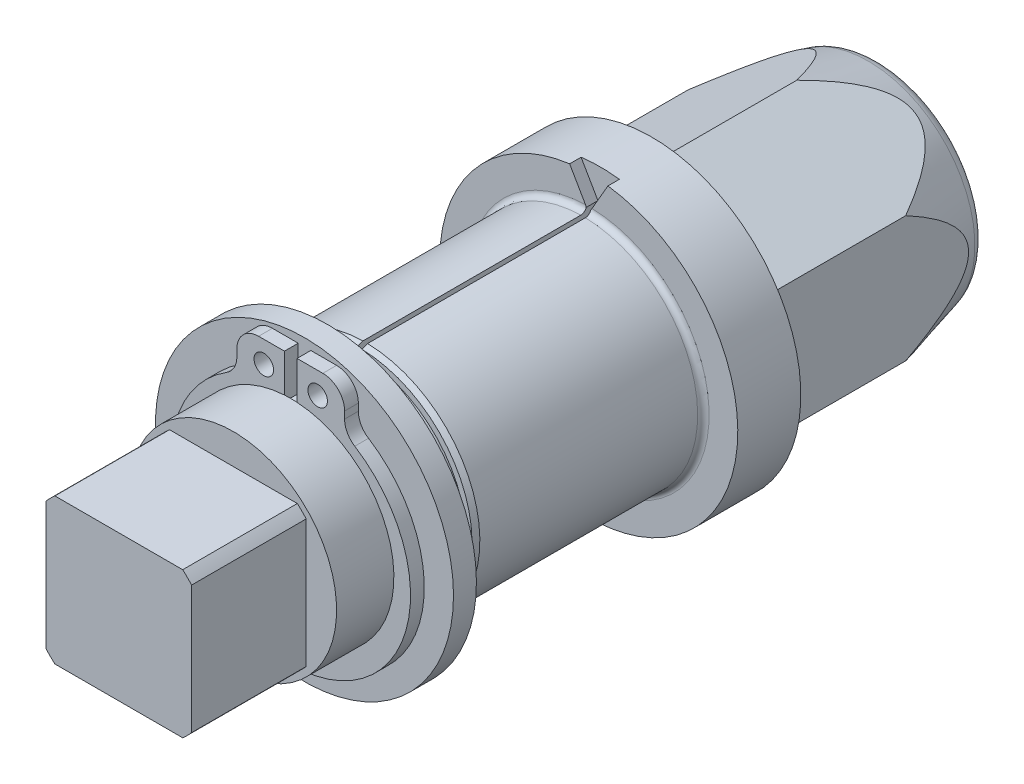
ISO-10303-21;
HEADER;
FILE_DESCRIPTION(('STEP AP214'),'2;1');
FILE_NAME('part.step','',(''),(''),'','','');
FILE_SCHEMA(('AUTOMOTIVE_DESIGN { 1 0 10303 214 1 1 1 1 }'));
ENDSEC;
DATA;
#1=APPLICATION_CONTEXT('core data for automotive mechanical design processes');
#2=APPLICATION_PROTOCOL_DEFINITION('international standard','automotive_design',2000,#1);
#3=PRODUCT_CONTEXT('',#1,'mechanical');
#4=PRODUCT('Part','Part','',(#3));
#5=PRODUCT_RELATED_PRODUCT_CATEGORY('part','',(#4));
#6=PRODUCT_DEFINITION_FORMATION('','',#4);
#7=PRODUCT_DEFINITION_CONTEXT('part definition',#1,'design');
#8=PRODUCT_DEFINITION('design','',#6,#7);
#9=PRODUCT_DEFINITION_SHAPE('','',#8);
#10=(LENGTH_UNIT() NAMED_UNIT(*) SI_UNIT(.MILLI.,.METRE.));
#11=(NAMED_UNIT(*) PLANE_ANGLE_UNIT() SI_UNIT($,.RADIAN.));
#12=(NAMED_UNIT(*) SI_UNIT($,.STERADIAN.) SOLID_ANGLE_UNIT());
#13=UNCERTAINTY_MEASURE_WITH_UNIT(LENGTH_MEASURE(1.E-05),#10,'distance_accuracy_value','');
#14=(GEOMETRIC_REPRESENTATION_CONTEXT(3) GLOBAL_UNCERTAINTY_ASSIGNED_CONTEXT((#13)) GLOBAL_UNIT_ASSIGNED_CONTEXT((#10,
#11,#12)) REPRESENTATION_CONTEXT('',''));
#15=CARTESIAN_POINT('',(0.,0.,0.));
#16=DIRECTION('',(0.,0.,1.));
#17=DIRECTION('',(1.,0.,0.));
#18=AXIS2_PLACEMENT_3D('',#15,#16,#17);
#19=CARTESIAN_POINT('',(0.,40.,46.75));
#20=DIRECTION('',(0.,0.,1.));
#21=DIRECTION('',(-1.,0.,0.));
#22=AXIS2_PLACEMENT_3D('',#19,#20,#21);
#23=CYLINDRICAL_SURFACE('',#22,9.);
#24=CARTESIAN_POINT('',(0.,40.,-11.6));
#25=DIRECTION('',(0.,0.,-1.));
#26=DIRECTION('',(1.,0.,0.));
#27=AXIS2_PLACEMENT_3D('',#24,#25,#26);
#28=CIRCLE('',#27,9.);
#29=CARTESIAN_POINT('',(9.,40.,-11.6));
#30=VERTEX_POINT('',#29);
#31=EDGE_CURVE('E26',#30,#30,#28,.F.);
#32=ORIENTED_EDGE('',*,*,#31,.T.);
#33=EDGE_LOOP('',(#32));
#34=FACE_BOUND('',#33,.T.);
#35=CARTESIAN_POINT('',(0.,40.,11.8));
#36=DIRECTION('',(0.,0.,-1.));
#37=DIRECTION('',(0.479360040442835,0.877618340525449,0.));
#38=AXIS2_PLACEMENT_3D('',#35,#36,#37);
#39=CIRCLE('',#38,9.);
#40=CARTESIAN_POINT('',(4.31424036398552,47.898565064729,11.8));
#41=VERTEX_POINT('',#40);
#42=EDGE_CURVE('E584',#41,#41,#39,.T.);
#43=ORIENTED_EDGE('',*,*,#42,.T.);
#44=EDGE_LOOP('',(#43));
#45=FACE_BOUND('',#44,.T.);
#46=DIRECTION('',(0.,0.,1.));
#47=VECTOR('',#46,1.);
#48=CARTESIAN_POINT('',(0.19999999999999,48.9977775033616,9.));
#49=LINE('',#48,#47);
#50=CARTESIAN_POINT('',(0.200000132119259,48.9977775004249,-11.5));
#51=VERTEX_POINT('',#50);
#52=CARTESIAN_POINT('',(0.199999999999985,48.9977775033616,8.7));
#53=VERTEX_POINT('',#52);
#54=EDGE_CURVE('E34',#51,#53,#49,.T.);
#55=ORIENTED_EDGE('',*,*,#54,.F.);
#56=CARTESIAN_POINT('',(0.,40.,-11.5));
#57=DIRECTION('',(0.,0.,1.));
#58=DIRECTION('',(1.,0.,0.));
#59=AXIS2_PLACEMENT_3D('',#56,#57,#58);
#60=CIRCLE('',#59,9.);
#61=CARTESIAN_POINT('',(-0.20000000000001,48.9977775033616,-11.5));
#62=VERTEX_POINT('',#61);
#63=EDGE_CURVE('E273',#62,#51,#60,.T.);
#64=ORIENTED_EDGE('',*,*,#63,.F.);
#65=DIRECTION('',(0.,0.,-1.));
#66=VECTOR('',#65,1.);
#67=CARTESIAN_POINT('',(-0.20000000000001,48.9977775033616,9.));
#68=LINE('',#67,#66);
#69=CARTESIAN_POINT('',(-0.199999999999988,48.9977775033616,8.7));
#70=VERTEX_POINT('',#69);
#71=EDGE_CURVE('E276',#70,#62,#68,.T.);
#72=ORIENTED_EDGE('',*,*,#71,.F.);
#73=CARTESIAN_POINT('',(0.,40.,8.7));
#74=DIRECTION('',(0.,0.,1.));
#75=DIRECTION('',(1.,0.,0.));
#76=AXIS2_PLACEMENT_3D('',#73,#74,#75);
#77=CIRCLE('',#76,9.);
#78=EDGE_CURVE('E39',#70,#53,#77,.T.);
#79=ORIENTED_EDGE('',*,*,#78,.T.);
#80=EDGE_LOOP('',(#55,#64,#72,#79));
#81=FACE_BOUND('',#80,.T.);
#82=ADVANCED_FACE('F16',(#34,#45,#81),#23,.T.);
#83=CARTESIAN_POINT('',(0.,31.,-12.));
#84=DIRECTION('',(0.,0.,-1.));
#85=DIRECTION('',(1.,0.,0.));
#86=AXIS2_PLACEMENT_3D('',#83,#84,#85);
#87=PLANE('',#86);
#88=CARTESIAN_POINT('',(0.,40.,-12.));
#89=DIRECTION('',(0.,0.,-1.));
#90=DIRECTION('',(1.,0.,0.));
#91=AXIS2_PLACEMENT_3D('',#88,#89,#90);
#92=CIRCLE('',#91,9.4);
#93=CARTESIAN_POINT('',(9.4,40.,-12.));
#94=VERTEX_POINT('',#93);
#95=EDGE_CURVE('E10',#94,#94,#92,.T.);
#96=ORIENTED_EDGE('',*,*,#95,.T.);
#97=EDGE_LOOP('',(#96));
#98=FACE_BOUND('',#97,.T.);
#99=DIRECTION('',(-0.499999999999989,0.866025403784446,0.));
#100=VECTOR('',#99,1.);
#101=CARTESIAN_POINT('',(-0.200000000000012,50.346410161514,-12.));
#102=LINE('',#101,#100);
#103=CARTESIAN_POINT('',(-0.200000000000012,50.346410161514,-12.));
#104=VERTEX_POINT('',#103);
#105=CARTESIAN_POINT('',(-1.66987298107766,52.8923048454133,-12.));
#106=VERTEX_POINT('',#105);
#107=EDGE_CURVE('E467',#104,#106,#102,.T.);
#108=ORIENTED_EDGE('',*,*,#107,.F.);
#109=DIRECTION('',(0.,1.,0.));
#110=VECTOR('',#109,1.);
#111=CARTESIAN_POINT('',(-0.2,40.,-12.));
#112=LINE('',#111,#110);
#113=CARTESIAN_POINT('',(-0.199999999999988,49.4978945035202,-12.));
#114=VERTEX_POINT('',#113);
#115=EDGE_CURVE('E463',#114,#104,#112,.T.);
#116=ORIENTED_EDGE('',*,*,#115,.F.);
#117=CARTESIAN_POINT('',(0.,40.,-12.));
#118=DIRECTION('',(0.,0.,1.));
#119=DIRECTION('',(1.,0.,0.));
#120=AXIS2_PLACEMENT_3D('',#117,#118,#119);
#121=CIRCLE('',#120,9.5);
#122=CARTESIAN_POINT('',(0.200000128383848,49.4978945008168,-12.));
#123=VERTEX_POINT('',#122);
#124=EDGE_CURVE('E285',#114,#123,#121,.T.);
#125=ORIENTED_EDGE('',*,*,#124,.T.);
#126=DIRECTION('',(0.,-1.,0.));
#127=VECTOR('',#126,1.);
#128=CARTESIAN_POINT('',(0.199999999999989,50.346410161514,-12.));
#129=LINE('',#128,#127);
#130=CARTESIAN_POINT('',(0.199999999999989,50.346410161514,-12.));
#131=VERTEX_POINT('',#130);
#132=EDGE_CURVE('E457',#131,#123,#129,.T.);
#133=ORIENTED_EDGE('',*,*,#132,.F.);
#134=DIRECTION('',(-0.499999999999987,-0.866025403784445,0.));
#135=VECTOR('',#134,1.);
#136=CARTESIAN_POINT('',(1.93984108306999,53.359903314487,-12.));
#137=LINE('',#136,#135);
#138=CARTESIAN_POINT('',(1.66987298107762,52.8923048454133,-12.));
#139=VERTEX_POINT('',#138);
#140=EDGE_CURVE('E454',#139,#131,#137,.T.);
#141=ORIENTED_EDGE('',*,*,#140,.F.);
#142=CARTESIAN_POINT('',(0.,40.,-12.));
#143=DIRECTION('',(0.,0.,1.));
#144=DIRECTION('',(-1.,0.,0.));
#145=AXIS2_PLACEMENT_3D('',#142,#143,#144);
#146=CIRCLE('',#145,13.);
#147=EDGE_CURVE('E760',#139,#106,#146,.T.);
#148=ORIENTED_EDGE('',*,*,#147,.T.);
#149=EDGE_LOOP('',(#108,#116,#125,#133,#141,#148));
#150=FACE_BOUND('',#149,.T.);
#151=ADVANCED_FACE('F691',(#98,#150),#87,.F.);
#152=CARTESIAN_POINT('',(9.5,34.5151724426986,-16.5));
#153=DIRECTION('',(0.5,-0.866025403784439,0.));
#154=DIRECTION('',(-0.866025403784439,-0.5,0.));
#155=AXIS2_PLACEMENT_3D('',#152,#153,#154);
#156=PLANE('',#155);
#157=DIRECTION('',(0.,0.,-1.));
#158=VECTOR('',#157,1.);
#159=CARTESIAN_POINT('',(0.,29.0303448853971,-16.5));
#160=LINE('',#159,#158);
#161=CARTESIAN_POINT('',(0.,29.0303448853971,-16.5));
#162=VERTEX_POINT('',#161);
#163=CARTESIAN_POINT('',(0.,29.0303448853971,-29.1491470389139));
#164=VERTEX_POINT('',#163);
#165=EDGE_CURVE('E777',#162,#164,#160,.T.);
#166=ORIENTED_EDGE('',*,*,#165,.T.);
#167=CARTESIAN_POINT('',(-9.28196428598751E-05,29.0302912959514,-29.1489470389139));
#168=CARTESIAN_POINT('',(0.0633524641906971,29.0669214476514,-29.285646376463));
#169=CARTESIAN_POINT('',(0.127531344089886,29.1039751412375,-29.4218905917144));
#170=CARTESIAN_POINT('',(0.25752620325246,29.1790277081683,-29.6933482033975));
#171=CARTESIAN_POINT('',(0.323342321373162,29.2170266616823,-29.8285615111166));
#172=CARTESIAN_POINT('',(0.523725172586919,29.3327177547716,-30.2329238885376));
#173=CARTESIAN_POINT('',(0.660999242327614,29.4119729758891,-30.5003024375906));
#174=CARTESIAN_POINT('',(0.946138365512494,29.5765981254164,-31.031840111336));
#175=CARTESIAN_POINT('',(1.09410959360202,29.6620293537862,-31.2959236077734));
#176=CARTESIAN_POINT('',(1.40154274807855,29.839525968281,-31.8148633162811));
#177=CARTESIAN_POINT('',(1.56099538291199,29.9315859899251,-32.0697267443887));
#178=CARTESIAN_POINT('',(1.80681149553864,30.0735079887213,-32.4349353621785));
#179=CARTESIAN_POINT('',(1.88731783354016,30.1199883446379,-32.5505403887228));
#180=CARTESIAN_POINT('',(2.05221171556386,30.215189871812,-32.7780404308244));
#181=CARTESIAN_POINT('',(2.13659970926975,30.2639113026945,-32.8899350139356));
#182=CARTESIAN_POINT('',(2.30975509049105,30.3638826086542,-33.1090133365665));
#183=CARTESIAN_POINT('',(2.39851963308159,30.4151308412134,-33.216200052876));
#184=CARTESIAN_POINT('',(2.58110804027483,30.5205483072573,-33.4246310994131));
#185=CARTESIAN_POINT('',(2.67493085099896,30.574716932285,-33.5258766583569));
#186=CARTESIAN_POINT('',(2.92329501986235,30.7181100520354,-33.776159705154));
#187=CARTESIAN_POINT('',(3.08208303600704,30.8097863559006,-33.9197198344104));
#188=CARTESIAN_POINT('',(3.41636648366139,31.0027849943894,-34.1781228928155));
#189=CARTESIAN_POINT('',(3.59181132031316,31.1040781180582,-34.2930491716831));
#190=CARTESIAN_POINT('',(3.89859159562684,31.2811977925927,-34.4485029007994));
#191=CARTESIAN_POINT('',(4.0252812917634,31.3543421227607,-34.5010643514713));
#192=CARTESIAN_POINT('',(4.2844084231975,31.5039492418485,-34.581593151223));
#193=CARTESIAN_POINT('',(4.41683798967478,31.5804074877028,-34.6095931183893));
#194=CARTESIAN_POINT('',(4.68474039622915,31.7350810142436,-34.6375722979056));
#195=CARTESIAN_POINT('',(4.82022624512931,31.8133038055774,-34.6373915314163));
#196=CARTESIAN_POINT('',(5.0889035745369,31.968424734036,-34.6086418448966));
#197=CARTESIAN_POINT('',(5.22209360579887,32.0453220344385,-34.5800556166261));
#198=CARTESIAN_POINT('',(5.50996930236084,32.2115271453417,-34.4894926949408));
#199=CARTESIAN_POINT('',(5.6632628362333,32.300031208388,-34.4217445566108));
#200=CARTESIAN_POINT('',(5.95858950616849,32.470538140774,-34.259068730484));
#201=CARTESIAN_POINT('',(6.10059599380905,32.5525256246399,-34.1640790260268));
#202=CARTESIAN_POINT('',(6.3581671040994,32.7012343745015,-33.9666536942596));
#203=CARTESIAN_POINT('',(6.4749151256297,32.7686388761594,-33.8662259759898));
#204=CARTESIAN_POINT('',(6.70061509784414,32.8989468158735,-33.6541963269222));
#205=CARTESIAN_POINT('',(6.80955993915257,32.9618461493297,-33.5425844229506));
#206=CARTESIAN_POINT('',(7.0213454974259,33.0841205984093,-33.310311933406));
#207=CARTESIAN_POINT('',(7.12413791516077,33.1434678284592,-33.1895932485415));
#208=CARTESIAN_POINT('',(7.32374964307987,33.2587137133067,-32.9418793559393));
#209=CARTESIAN_POINT('',(7.42057132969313,33.3146137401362,-32.8148866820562));
#210=CARTESIAN_POINT('',(7.61475267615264,33.4267243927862,-32.5483200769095));
#211=CARTESIAN_POINT('',(7.71180263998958,33.4827562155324,-32.4084469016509));
#212=CARTESIAN_POINT('',(7.90107178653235,33.5920308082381,-32.1243936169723));
#213=CARTESIAN_POINT('',(7.99329006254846,33.6452730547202,-31.9802127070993));
#214=CARTESIAN_POINT('',(8.26397622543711,33.8015537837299,-31.5422195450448));
#215=CARTESIAN_POINT('',(8.43623709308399,33.9010086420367,-31.2432937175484));
#216=CARTESIAN_POINT('',(8.7621134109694,34.0891534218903,-30.6477355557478));
#217=CARTESIAN_POINT('',(8.91618353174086,34.1781058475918,-30.3514296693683));
#218=CARTESIAN_POINT('',(9.14021237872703,34.3074489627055,-29.9029441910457));
#219=CARTESIAN_POINT('',(9.21359464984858,34.3498162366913,-29.7530271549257));
#220=CARTESIAN_POINT('',(9.35831617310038,34.4333712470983,-29.4519078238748));
#221=CARTESIAN_POINT('',(9.42965568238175,34.4745591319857,-29.3007056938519));
#222=CARTESIAN_POINT('',(9.50009281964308,34.5152260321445,-29.1489470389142));
#223=B_SPLINE_CURVE_WITH_KNOTS('',3,(#167,#168,#169,#170,#171,#172,#173,#174,#175,#176,#177,
#178,#179,#180,#181,#182,#183,#184,#185,#186,#187,#188,#189,#190,#191,#192,#193,#194,#195,#196,
#197,#198,#199,#200,#201,#202,#203,#204,#205,#206,#207,#208,#209,#210,#211,#212,#213,#214,#215,
#216,#217,#218,#219,#220,#221,#222),.UNSPECIFIED.,.F.,.F.,(4,2,2,2,2,2,2,2,2,2,2,2,2,2,2,2,2,2,
2,2,2,2,2,2,2,2,2,4),(0.,0.465271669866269,0.930582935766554,1.86288009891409,2.80621835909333,
3.74880160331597,4.19374668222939,4.63874343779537,5.08345464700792,5.52807355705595,
6.22496409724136,6.91980172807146,7.38441639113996,7.84841309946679,8.31504396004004,
8.78195932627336,9.34736634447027,9.91407089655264,10.417652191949,10.9216866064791,
11.4292645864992,11.9366392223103,12.4741532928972,13.011767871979,14.0882991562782,
15.124886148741,15.6414873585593,16.1580232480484),.UNSPECIFIED.);
#224=CARTESIAN_POINT('',(9.5,34.5151724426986,-29.1491470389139));
#225=VERTEX_POINT('',#224);
#226=EDGE_CURVE('E657',#164,#225,#223,.T.);
#227=ORIENTED_EDGE('',*,*,#226,.T.);
#228=DIRECTION('',(0.,0.,-1.));
#229=VECTOR('',#228,1.);
#230=CARTESIAN_POINT('',(9.5,34.5151724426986,-16.5));
#231=LINE('',#230,#229);
#232=CARTESIAN_POINT('',(9.5,34.5151724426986,-16.5));
#233=VERTEX_POINT('',#232);
#234=EDGE_CURVE('E769',#233,#225,#231,.T.);
#235=ORIENTED_EDGE('',*,*,#234,.F.);
#236=DIRECTION('',(-0.866025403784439,-0.5,0.));
#237=VECTOR('',#236,1.);
#238=CARTESIAN_POINT('',(9.5,34.5151724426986,-16.5));
#239=LINE('',#238,#237);
#240=EDGE_CURVE('E838',#233,#162,#239,.T.);
#241=ORIENTED_EDGE('',*,*,#240,.T.);
#242=EDGE_LOOP('',(#166,#227,#235,#241));
#243=FACE_BOUND('',#242,.T.);
#244=ADVANCED_FACE('F668',(#243),#156,.T.);
#245=CARTESIAN_POINT('',(9.5,45.4848275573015,-16.5));
#246=DIRECTION('',(1.,0.,0.));
#247=DIRECTION('',(0.,0.,1.));
#248=AXIS2_PLACEMENT_3D('',#245,#246,#247);
#249=PLANE('',#248);
#250=ORIENTED_EDGE('',*,*,#234,.T.);
#251=CARTESIAN_POINT('',(9.5,50.5930853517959,-16.9852353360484));
#252=CARTESIAN_POINT('',(9.5,50.3867862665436,-17.5582720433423));
#253=CARTESIAN_POINT('',(9.5,50.1781960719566,-18.1304959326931));
#254=CARTESIAN_POINT('',(9.5,49.7553161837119,-19.2729685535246));
#255=CARTESIAN_POINT('',(9.5,49.541025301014,-19.8432168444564));
#256=CARTESIAN_POINT('',(9.5,49.103829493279,-20.9860699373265));
#257=CARTESIAN_POINT('',(9.5,48.8808660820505,-21.5586524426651));
#258=CARTESIAN_POINT('',(9.5,48.426567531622,-22.7003990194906));
#259=CARTESIAN_POINT('',(9.5,48.1952335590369,-23.2695635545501));
#260=CARTESIAN_POINT('',(9.5,47.6963864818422,-24.4651862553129));
#261=CARTESIAN_POINT('',(9.5,47.4276738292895,-25.0911483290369));
#262=CARTESIAN_POINT('',(9.5,47.0117602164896,-26.0245512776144));
#263=CARTESIAN_POINT('',(9.5,46.8709448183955,-26.3348389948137));
#264=CARTESIAN_POINT('',(9.5,46.5843063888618,-26.953088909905));
#265=CARTESIAN_POINT('',(9.5,46.4384835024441,-27.2610511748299));
#266=CARTESIAN_POINT('',(9.5,46.1415186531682,-27.8728776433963));
#267=CARTESIAN_POINT('',(9.5,45.9904004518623,-28.176753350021));
#268=CARTESIAN_POINT('',(9.5,45.6811324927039,-28.7808941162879));
#269=CARTESIAN_POINT('',(9.5,45.5229832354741,-29.0811594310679));
#270=CARTESIAN_POINT('',(9.5,45.1982205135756,-29.676791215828));
#271=CARTESIAN_POINT('',(9.5,45.0316137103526,-29.9721613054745));
#272=CARTESIAN_POINT('',(9.5,44.6877594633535,-30.5566144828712));
#273=CARTESIAN_POINT('',(9.5,44.5105147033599,-30.8456991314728));
#274=CARTESIAN_POINT('',(9.5,44.2584714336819,-31.2355351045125));
#275=CARTESIAN_POINT('',(9.5,44.1895511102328,-31.3400955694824));
#276=CARTESIAN_POINT('',(9.5,44.0496437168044,-31.5478279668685));
#277=CARTESIAN_POINT('',(9.5,43.9786565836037,-31.6509998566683));
#278=CARTESIAN_POINT('',(9.5,43.7621982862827,-31.9582448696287));
#279=CARTESIAN_POINT('',(9.5,43.6133011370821,-32.1599365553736));
#280=CARTESIAN_POINT('',(9.5,43.3057063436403,-32.5526715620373));
#281=CARTESIAN_POINT('',(9.5,43.1471158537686,-32.7437981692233));
#282=CARTESIAN_POINT('',(9.5,42.8161952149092,-33.1136485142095));
#283=CARTESIAN_POINT('',(9.5,42.6438790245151,-33.2923845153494));
#284=CARTESIAN_POINT('',(9.5,42.3171328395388,-33.5983747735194));
#285=CARTESIAN_POINT('',(9.5,42.1657769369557,-33.7288679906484));
#286=CARTESIAN_POINT('',(9.5,41.8494365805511,-33.9730093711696));
#287=CARTESIAN_POINT('',(9.5,41.6844308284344,-34.0866304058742));
#288=CARTESIAN_POINT('',(9.5,41.3365493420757,-34.29060023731));
#289=CARTESIAN_POINT('',(9.5,41.1534398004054,-34.3805684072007));
#290=CARTESIAN_POINT('',(9.5,40.8686684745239,-34.4878056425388));
#291=CARTESIAN_POINT('',(9.5,40.7721844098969,-34.5189110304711));
#292=CARTESIAN_POINT('',(9.5,40.576470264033,-34.5706280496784));
#293=CARTESIAN_POINT('',(9.5,40.4772416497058,-34.5912451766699));
#294=CARTESIAN_POINT('',(9.5,40.231365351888,-34.627603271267));
#295=CARTESIAN_POINT('',(9.5,40.0836886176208,-34.6368552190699));
#296=CARTESIAN_POINT('',(9.5,39.7889821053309,-34.6295017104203));
#297=CARTESIAN_POINT('',(9.5,39.6419525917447,-34.6128865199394));
#298=CARTESIAN_POINT('',(9.5,39.353476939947,-34.5560201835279));
#299=CARTESIAN_POINT('',(9.5,39.2120056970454,-34.5158926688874));
#300=CARTESIAN_POINT('',(9.5,38.9362681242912,-34.4160947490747));
#301=CARTESIAN_POINT('',(9.5,38.8020038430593,-34.3564188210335));
#302=CARTESIAN_POINT('',(9.5,38.5542599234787,-34.2283999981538));
#303=CARTESIAN_POINT('',(9.5,38.4400315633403,-34.1614747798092));
#304=CARTESIAN_POINT('',(9.5,38.2178498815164,-34.0178286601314));
#305=CARTESIAN_POINT('',(9.5,38.109901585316,-33.9411000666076));
#306=CARTESIAN_POINT('',(9.5,37.8994986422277,-33.7797145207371));
#307=CARTESIAN_POINT('',(9.5,37.7970668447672,-33.6950280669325));
#308=CARTESIAN_POINT('',(9.5,37.5975808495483,-33.5196470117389));
#309=CARTESIAN_POINT('',(9.5,37.5005250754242,-33.4289541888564));
#310=CARTESIAN_POINT('',(9.5,37.2658543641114,-33.1982569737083));
#311=CARTESIAN_POINT('',(9.5,37.1310388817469,-33.0554114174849));
#312=CARTESIAN_POINT('',(9.5,36.8699701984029,-32.7620515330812));
#313=CARTESIAN_POINT('',(9.5,36.7437218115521,-32.6115329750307));
#314=CARTESIAN_POINT('',(9.5,36.4982092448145,-32.3044804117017));
#315=CARTESIAN_POINT('',(9.5,36.3789583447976,-32.1479358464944));
#316=CARTESIAN_POINT('',(9.5,36.1465382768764,-31.8303893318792));
#317=CARTESIAN_POINT('',(9.5,36.0333698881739,-31.6693868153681));
#318=CARTESIAN_POINT('',(9.5,35.8109284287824,-31.3419762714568));
#319=CARTESIAN_POINT('',(9.5,35.701716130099,-31.1755271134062));
#320=CARTESIAN_POINT('',(9.5,35.4878361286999,-30.8397339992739));
#321=CARTESIAN_POINT('',(9.5,35.3831686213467,-30.6703899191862));
#322=CARTESIAN_POINT('',(9.5,35.1779042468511,-30.3295608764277));
#323=CARTESIAN_POINT('',(9.5,35.077302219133,-30.1580790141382));
#324=CARTESIAN_POINT('',(9.5,34.8795372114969,-29.8131585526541));
#325=CARTESIAN_POINT('',(9.5,34.7823740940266,-29.6397200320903));
#326=CARTESIAN_POINT('',(9.5,34.4574133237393,-29.0477669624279));
#327=CARTESIAN_POINT('',(9.5,34.2367294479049,-28.625341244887));
#328=CARTESIAN_POINT('',(9.5,33.8083699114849,-27.7739194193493));
#329=CARTESIAN_POINT('',(9.5,33.6006967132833,-27.3449220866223));
#330=CARTESIAN_POINT('',(9.5,33.1954710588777,-26.4818863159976));
#331=CARTESIAN_POINT('',(9.5,32.9979245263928,-26.0478451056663));
#332=CARTESIAN_POINT('',(9.5,32.6110627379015,-25.1761064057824));
#333=CARTESIAN_POINT('',(9.5,32.4217477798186,-24.7384087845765));
#334=CARTESIAN_POINT('',(9.5,32.0492864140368,-23.8587559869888));
#335=CARTESIAN_POINT('',(9.5,31.8661616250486,-23.4167916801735));
#336=CARTESIAN_POINT('',(9.5,31.505586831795,-22.5305513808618));
#337=CARTESIAN_POINT('',(9.5,31.3281369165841,-22.0862753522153));
#338=CARTESIAN_POINT('',(9.5,30.9781041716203,-21.1959980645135));
#339=CARTESIAN_POINT('',(9.5,30.8055196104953,-20.7499974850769));
#340=CARTESIAN_POINT('',(9.5,30.4644646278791,-19.8564246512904));
#341=CARTESIAN_POINT('',(9.5,30.2959942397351,-19.4088523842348));
#342=CARTESIAN_POINT('',(9.5,29.8336718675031,-18.1657059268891));
#343=CARTESIAN_POINT('',(9.5,29.5436256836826,-17.3687160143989));
#344=CARTESIAN_POINT('',(9.5,28.9723121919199,-15.7715157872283));
#345=CARTESIAN_POINT('',(9.5,28.6910457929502,-14.9713051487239));
#346=CARTESIAN_POINT('',(9.5,28.1373651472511,-13.3733796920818));
#347=CARTESIAN_POINT('',(9.5,27.8649068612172,-12.5756801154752));
#348=CARTESIAN_POINT('',(9.5,27.4605978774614,-11.3777208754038));
#349=CARTESIAN_POINT('',(9.5,27.3265673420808,-10.9781946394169));
#350=CARTESIAN_POINT('',(9.5,27.0598387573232,-10.178699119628));
#351=CARTESIAN_POINT('',(9.5,26.9271407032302,-9.77872983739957));
#352=CARTESIAN_POINT('',(9.5,26.7950483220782,-9.3785604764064));
#353=B_SPLINE_CURVE_WITH_KNOTS('',3,(#251,#252,#253,#254,#255,#256,#257,#258,#259,#260,#261,
#262,#263,#264,#265,#266,#267,#268,#269,#270,#271,#272,#273,#274,#275,#276,#277,#278,#279,#280,
#281,#282,#283,#284,#285,#286,#287,#288,#289,#290,#291,#292,#293,#294,#295,#296,#297,#298,#299,
#300,#301,#302,#303,#304,#305,#306,#307,#308,#309,#310,#311,#312,#313,#314,#315,#316,#317,#318,
#319,#320,#321,#322,#323,#324,#325,#326,#327,#328,#329,#330,#331,#332,#333,#334,#335,#336,#337,
#338,#339,#340,#341,#342,#343,#344,#345,#346,#347,#348,#349,#350,#351,#352),.UNSPECIFIED.,.F.,
.F.,(4,2,2,2,2,2,2,2,2,2,2,2,2,2,2,2,2,2,2,2,2,2,2,2,2,2,2,2,2,2,2,2,2,2,2,2,2,2,2,2,2,2,2,2,2,
2,2,2,2,2,4),(0.,1.82713326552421,3.65465066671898,5.49797926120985,7.34105193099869,
9.38443436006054,10.4066360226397,11.4288081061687,12.4468675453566,13.4648546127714,
14.4820519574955,15.4989937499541,15.874666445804,16.2503506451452,17.0021133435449,
17.7466979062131,18.490534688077,19.0891789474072,19.6887755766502,20.2975003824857,
20.6011206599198,20.9045816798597,21.3461445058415,21.7878735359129,22.227300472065,
22.6668516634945,23.0634308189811,23.460323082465,23.8587495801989,24.2570586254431,
24.8458435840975,25.434956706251,26.0251539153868,26.615426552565,27.2125787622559,
27.8097566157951,28.4061509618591,29.00252142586,30.431961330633,31.8616709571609,
33.2922075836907,34.7227959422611,36.1579506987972,37.593127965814,39.0277878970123,
40.462459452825,43.0067672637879,45.5513376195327,48.080146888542,49.3443715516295,
50.6085917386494),.UNSPECIFIED.);
#354=CARTESIAN_POINT('',(9.5,45.4848275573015,-29.1491470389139));
#355=VERTEX_POINT('',#354);
#356=EDGE_CURVE('E650',#225,#355,#353,.F.);
#357=ORIENTED_EDGE('',*,*,#356,.T.);
#358=DIRECTION('',(0.,0.,-1.));
#359=VECTOR('',#358,1.);
#360=CARTESIAN_POINT('',(9.5,45.4848275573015,-16.5));
#361=LINE('',#360,#359);
#362=CARTESIAN_POINT('',(9.5,45.4848275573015,-16.5));
#363=VERTEX_POINT('',#362);
#364=EDGE_CURVE('E774',#363,#355,#361,.T.);
#365=ORIENTED_EDGE('',*,*,#364,.F.);
#366=DIRECTION('',(0.,-1.,0.));
#367=VECTOR('',#366,1.);
#368=CARTESIAN_POINT('',(9.5,45.4848275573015,-16.5));
#369=LINE('',#368,#367);
#370=EDGE_CURVE('E853',#363,#233,#369,.T.);
#371=ORIENTED_EDGE('',*,*,#370,.T.);
#372=EDGE_LOOP('',(#250,#357,#365,#371));
#373=FACE_BOUND('',#372,.T.);
#374=ADVANCED_FACE('F663',(#373),#249,.T.);
#375=CARTESIAN_POINT('',(0.,50.9696551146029,-16.5));
#376=DIRECTION('',(0.5,0.866025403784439,0.));
#377=DIRECTION('',(0.866025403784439,-0.5,0.));
#378=AXIS2_PLACEMENT_3D('',#375,#376,#377);
#379=PLANE('',#378);
#380=ORIENTED_EDGE('',*,*,#364,.T.);
#381=CARTESIAN_POINT('',(9.50009281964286,45.4847739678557,-29.1489470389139));
#382=CARTESIAN_POINT('',(9.43664753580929,45.5214041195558,-29.2856463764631));
#383=CARTESIAN_POINT('',(9.37246865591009,45.5584578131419,-29.4218905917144));
#384=CARTESIAN_POINT('',(9.24247379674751,45.6335103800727,-29.6933482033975));
#385=CARTESIAN_POINT('',(9.17665767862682,45.6715093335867,-29.8285615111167));
#386=CARTESIAN_POINT('',(8.97627482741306,45.7872004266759,-30.2329238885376));
#387=CARTESIAN_POINT('',(8.83900075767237,45.8664556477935,-30.5003024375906));
#388=CARTESIAN_POINT('',(8.55386163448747,46.0310807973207,-31.0318401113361));
#389=CARTESIAN_POINT('',(8.40589040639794,46.1165120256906,-31.2959236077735));
#390=CARTESIAN_POINT('',(8.09845725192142,46.2940086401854,-31.8148633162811));
#391=CARTESIAN_POINT('',(7.93900461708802,46.3860686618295,-32.0697267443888));
#392=CARTESIAN_POINT('',(7.69318850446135,46.5279906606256,-32.4349353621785));
#393=CARTESIAN_POINT('',(7.61268216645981,46.5744710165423,-32.5505403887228));
#394=CARTESIAN_POINT('',(7.4477882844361,46.6696725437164,-32.7780404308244));
#395=CARTESIAN_POINT('',(7.36340029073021,46.7183939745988,-32.8899350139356));
#396=CARTESIAN_POINT('',(7.19024490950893,46.8183652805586,-33.1090133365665));
#397=CARTESIAN_POINT('',(7.10148036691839,46.8696135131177,-33.216200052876));
#398=CARTESIAN_POINT('',(6.91889195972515,46.9750309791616,-33.424631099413));
#399=CARTESIAN_POINT('',(6.82506914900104,47.0291996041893,-33.5258766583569));
#400=CARTESIAN_POINT('',(6.57670498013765,47.1725927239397,-33.776159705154));
#401=CARTESIAN_POINT('',(6.41791696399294,47.2642690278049,-33.9197198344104));
#402=CARTESIAN_POINT('',(6.0836335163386,47.4572676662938,-34.1781228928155));
#403=CARTESIAN_POINT('',(5.90818867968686,47.5585607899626,-34.2930491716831));
#404=CARTESIAN_POINT('',(5.60140840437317,47.7356804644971,-34.4485029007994));
#405=CARTESIAN_POINT('',(5.47471870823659,47.808824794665,-34.5010643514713));
#406=CARTESIAN_POINT('',(5.21559157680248,47.9584319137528,-34.581593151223));
#407=CARTESIAN_POINT('',(5.08316201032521,48.0348901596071,-34.6095931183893));
#408=CARTESIAN_POINT('',(4.81525960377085,48.1895636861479,-34.6375722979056));
#409=CARTESIAN_POINT('',(4.6797737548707,48.2677864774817,-34.6373915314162));
#410=CARTESIAN_POINT('',(4.41109642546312,48.4229074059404,-34.6086418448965));
#411=CARTESIAN_POINT('',(4.27790639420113,48.4998047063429,-34.5800556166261));
#412=CARTESIAN_POINT('',(3.99003069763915,48.6660098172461,-34.4894926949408));
#413=CARTESIAN_POINT('',(3.8367371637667,48.7545138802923,-34.4217445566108));
#414=CARTESIAN_POINT('',(3.54141049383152,48.9250208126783,-34.2590687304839));
#415=CARTESIAN_POINT('',(3.39940400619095,49.0070082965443,-34.1640790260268));
#416=CARTESIAN_POINT('',(3.1418328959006,49.1557170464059,-33.9666536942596));
#417=CARTESIAN_POINT('',(3.0250848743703,49.2231215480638,-33.8662259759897));
#418=CARTESIAN_POINT('',(2.79938490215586,49.3534294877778,-33.6541963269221));
#419=CARTESIAN_POINT('',(2.69044006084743,49.4163288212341,-33.5425844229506));
#420=CARTESIAN_POINT('',(2.4786545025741,49.5386032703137,-33.310311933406));
#421=CARTESIAN_POINT('',(2.37586208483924,49.5979505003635,-33.1895932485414));
#422=CARTESIAN_POINT('',(2.17625035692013,49.7131963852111,-32.9418793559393));
#423=CARTESIAN_POINT('',(2.07942867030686,49.7690964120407,-32.8148866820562));
#424=CARTESIAN_POINT('',(1.88524732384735,49.8812070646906,-32.5483200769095));
#425=CARTESIAN_POINT('',(1.78819736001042,49.9372388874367,-32.4084469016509));
#426=CARTESIAN_POINT('',(1.59892821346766,50.0465134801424,-32.1243936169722));
#427=CARTESIAN_POINT('',(1.50670993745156,50.0997557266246,-31.9802127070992));
#428=CARTESIAN_POINT('',(1.2360237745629,50.2560364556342,-31.5422195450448));
#429=CARTESIAN_POINT('',(1.06376290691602,50.355491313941,-31.2432937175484));
#430=CARTESIAN_POINT('',(0.737886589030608,50.5436360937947,-30.6477355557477));
#431=CARTESIAN_POINT('',(0.583816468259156,50.6325885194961,-30.3514296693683));
#432=CARTESIAN_POINT('',(0.359787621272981,50.7619316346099,-29.9029441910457));
#433=CARTESIAN_POINT('',(0.28640535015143,50.8042989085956,-29.7530271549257));
#434=CARTESIAN_POINT('',(0.141683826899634,50.8878539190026,-29.4519078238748));
#435=CARTESIAN_POINT('',(0.0703443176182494,50.92904180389,-29.3007056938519));
#436=CARTESIAN_POINT('',(-9.28196430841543E-05,50.9697087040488,-29.1489470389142));
#437=B_SPLINE_CURVE_WITH_KNOTS('',3,(#381,#382,#383,#384,#385,#386,#387,#388,#389,#390,#391,
#392,#393,#394,#395,#396,#397,#398,#399,#400,#401,#402,#403,#404,#405,#406,#407,#408,#409,#410,
#411,#412,#413,#414,#415,#416,#417,#418,#419,#420,#421,#422,#423,#424,#425,#426,#427,#428,#429,
#430,#431,#432,#433,#434,#435,#436),.UNSPECIFIED.,.F.,.F.,(4,2,2,2,2,2,2,2,2,2,2,2,2,2,2,2,2,2,
2,2,2,2,2,2,2,2,2,4),(0.,0.465271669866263,0.930582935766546,1.86288009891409,2.80621835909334,
3.74880160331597,4.19374668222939,4.63874343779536,5.08345464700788,5.52807355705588,
6.22496409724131,6.91980172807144,7.38441639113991,7.8484130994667,8.31504396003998,
8.78195932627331,9.34736634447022,9.9140708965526,10.417652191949,10.921686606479,
11.4292645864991,11.9366392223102,12.4741532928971,13.011767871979,14.0882991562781,
15.1248861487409,15.6414873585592,16.1580232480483),.UNSPECIFIED.);
#438=CARTESIAN_POINT('',(0.,50.9696551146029,-29.1491470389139));
#439=VERTEX_POINT('',#438);
#440=EDGE_CURVE('E643',#355,#439,#437,.T.);
#441=ORIENTED_EDGE('',*,*,#440,.T.);
#442=DIRECTION('',(0.,0.,-1.));
#443=VECTOR('',#442,1.);
#444=CARTESIAN_POINT('',(0.,50.9696551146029,-16.5));
#445=LINE('',#444,#443);
#446=CARTESIAN_POINT('',(0.,50.9696551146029,-16.5));
#447=VERTEX_POINT('',#446);
#448=EDGE_CURVE('E858',#447,#439,#445,.T.);
#449=ORIENTED_EDGE('',*,*,#448,.F.);
#450=DIRECTION('',(0.866025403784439,-0.5,0.));
#451=VECTOR('',#450,1.);
#452=CARTESIAN_POINT('',(0.,50.9696551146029,-16.5));
#453=LINE('',#452,#451);
#454=EDGE_CURVE('E850',#447,#363,#453,.T.);
#455=ORIENTED_EDGE('',*,*,#454,.T.);
#456=EDGE_LOOP('',(#380,#441,#449,#455));
#457=FACE_BOUND('',#456,.T.);
#458=ADVANCED_FACE('F667',(#457),#379,.T.);
#459=CARTESIAN_POINT('',(-9.5,45.4848275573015,-16.5));
#460=DIRECTION('',(-0.5,0.866025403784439,0.));
#461=DIRECTION('',(0.866025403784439,0.5,0.));
#462=AXIS2_PLACEMENT_3D('',#459,#460,#461);
#463=PLANE('',#462);
#464=ORIENTED_EDGE('',*,*,#448,.T.);
#465=CARTESIAN_POINT('',(9.28196428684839E-05,50.9697087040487,-29.1489470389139));
#466=CARTESIAN_POINT('',(-0.0633524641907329,50.9330785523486,-29.285646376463));
#467=CARTESIAN_POINT('',(-0.12753134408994,50.8960248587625,-29.4218905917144));
#468=CARTESIAN_POINT('',(-0.257526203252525,50.8209722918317,-29.6933482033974));
#469=CARTESIAN_POINT('',(-0.323342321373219,50.7829733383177,-29.8285615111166));
#470=CARTESIAN_POINT('',(-0.523725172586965,50.6672822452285,-30.2329238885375));
#471=CARTESIAN_POINT('',(-0.660999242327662,50.5880270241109,-30.5003024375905));
#472=CARTESIAN_POINT('',(-0.946138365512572,50.4234018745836,-31.031840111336));
#473=CARTESIAN_POINT('',(-1.09410959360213,50.3379706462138,-31.2959236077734));
#474=CARTESIAN_POINT('',(-1.40154274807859,50.160474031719,-31.8148633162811));
#475=CARTESIAN_POINT('',(-1.56099538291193,50.0684140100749,-32.0697267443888));
#476=CARTESIAN_POINT('',(-1.80681149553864,49.9264920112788,-32.4349353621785));
#477=CARTESIAN_POINT('',(-1.88731783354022,49.8800116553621,-32.5505403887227));
#478=CARTESIAN_POINT('',(-2.05221171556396,49.784810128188,-32.7780404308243));
#479=CARTESIAN_POINT('',(-2.13659970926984,49.7360886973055,-32.8899350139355));
#480=CARTESIAN_POINT('',(-2.30975509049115,49.6361173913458,-33.1090133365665));
#481=CARTESIAN_POINT('',(-2.39851963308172,49.5848691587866,-33.216200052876));
#482=CARTESIAN_POINT('',(-2.58110804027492,49.4794516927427,-33.424631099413));
#483=CARTESIAN_POINT('',(-2.67493085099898,49.425283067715,-33.525876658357));
#484=CARTESIAN_POINT('',(-2.92329501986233,49.2818899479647,-33.776159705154));
#485=CARTESIAN_POINT('',(-3.08208303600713,49.1902136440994,-33.9197198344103));
#486=CARTESIAN_POINT('',(-3.41636648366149,48.9972150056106,-34.1781228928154));
#487=CARTESIAN_POINT('',(-3.59181132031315,48.8959218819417,-34.2930491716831));
#488=CARTESIAN_POINT('',(-3.89859159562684,48.7188022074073,-34.4485029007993));
#489=CARTESIAN_POINT('',(-4.02528129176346,48.6456578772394,-34.5010643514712));
#490=CARTESIAN_POINT('',(-4.28440842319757,48.4960507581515,-34.5815931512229));
#491=CARTESIAN_POINT('',(-4.41683798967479,48.4195925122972,-34.6095931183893));
#492=CARTESIAN_POINT('',(-4.68474039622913,48.2649189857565,-34.6375722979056));
#493=CARTESIAN_POINT('',(-4.8202262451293,48.1866961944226,-34.6373915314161));
#494=CARTESIAN_POINT('',(-5.0889035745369,48.031575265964,-34.6086418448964));
#495=CARTESIAN_POINT('',(-5.22209360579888,47.9546779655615,-34.580055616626));
#496=CARTESIAN_POINT('',(-5.50996930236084,47.7884728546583,-34.4894926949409));
#497=CARTESIAN_POINT('',(-5.66326283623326,47.6999687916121,-34.4217445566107));
#498=CARTESIAN_POINT('',(-5.95858950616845,47.5294618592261,-34.2590687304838));
#499=CARTESIAN_POINT('',(-6.10059599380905,47.4474743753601,-34.1640790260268));
#500=CARTESIAN_POINT('',(-6.3581671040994,47.2987656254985,-33.9666536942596));
#501=CARTESIAN_POINT('',(-6.47491512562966,47.2313611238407,-33.8662259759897));
#502=CARTESIAN_POINT('',(-6.70061509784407,47.1010531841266,-33.654196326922));
#503=CARTESIAN_POINT('',(-6.80955993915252,47.0381538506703,-33.5425844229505));
#504=CARTESIAN_POINT('',(-7.02134549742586,46.9158794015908,-33.3103119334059));
#505=CARTESIAN_POINT('',(-7.12413791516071,46.8565321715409,-33.1895932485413));
#506=CARTESIAN_POINT('',(-7.32374964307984,46.7412862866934,-32.9418793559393));
#507=CARTESIAN_POINT('',(-7.42057132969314,46.6853862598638,-32.8148866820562));
#508=CARTESIAN_POINT('',(-7.61475267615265,46.5732756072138,-32.5483200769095));
#509=CARTESIAN_POINT('',(-7.71180263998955,46.5172437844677,-32.4084469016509));
#510=CARTESIAN_POINT('',(-7.90107178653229,46.407969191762,-32.1243936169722));
#511=CARTESIAN_POINT('',(-7.9932900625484,46.3547269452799,-31.9802127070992));
#512=CARTESIAN_POINT('',(-8.26397622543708,46.1984462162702,-31.5422195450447));
#513=CARTESIAN_POINT('',(-8.43623709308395,46.0989913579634,-31.2432937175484));
#514=CARTESIAN_POINT('',(-8.76211341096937,45.9108465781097,-30.6477355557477));
#515=CARTESIAN_POINT('',(-8.91618353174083,45.8218941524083,-30.3514296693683));
#516=CARTESIAN_POINT('',(-9.14021237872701,45.6925510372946,-29.9029441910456));
#517=CARTESIAN_POINT('',(-9.21359464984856,45.6501837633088,-29.7530271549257));
#518=CARTESIAN_POINT('',(-9.35831617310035,45.5666287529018,-29.4519078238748));
#519=CARTESIAN_POINT('',(-9.42965568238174,45.5254408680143,-29.3007056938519));
#520=CARTESIAN_POINT('',(-9.50009281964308,45.4847739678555,-29.1489470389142));
#521=B_SPLINE_CURVE_WITH_KNOTS('',3,(#465,#466,#467,#468,#469,#470,#471,#472,#473,#474,#475,
#476,#477,#478,#479,#480,#481,#482,#483,#484,#485,#486,#487,#488,#489,#490,#491,#492,#493,#494,
#495,#496,#497,#498,#499,#500,#501,#502,#503,#504,#505,#506,#507,#508,#509,#510,#511,#512,#513,
#514,#515,#516,#517,#518,#519,#520),.UNSPECIFIED.,.F.,.F.,(4,2,2,2,2,2,2,2,2,2,2,2,2,2,2,2,2,2,
2,2,2,2,2,2,2,2,2,4),(0.,0.465271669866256,0.93058293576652,1.86288009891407,2.80621835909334,
3.74880160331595,4.19374668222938,4.63874343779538,5.08345464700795,5.52807355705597,
6.22496409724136,6.91980172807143,7.38441639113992,7.84841309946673,8.31504396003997,
8.78195932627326,9.34736634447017,9.91407089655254,10.4176521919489,10.921686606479,
11.429264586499,11.9366392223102,12.474153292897,13.0117678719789,14.088299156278,
15.1248861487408,15.6414873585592,16.1580232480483),.UNSPECIFIED.);
#522=CARTESIAN_POINT('',(-9.5,45.4848275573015,-29.1491470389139));
#523=VERTEX_POINT('',#522);
#524=EDGE_CURVE('E636',#439,#523,#521,.T.);
#525=ORIENTED_EDGE('',*,*,#524,.T.);
#526=DIRECTION('',(0.,0.,-1.));
#527=VECTOR('',#526,1.);
#528=CARTESIAN_POINT('',(-9.5,45.4848275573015,-16.5));
#529=LINE('',#528,#527);
#530=CARTESIAN_POINT('',(-9.5,45.4848275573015,-16.5));
#531=VERTEX_POINT('',#530);
#532=EDGE_CURVE('E861',#531,#523,#529,.T.);
#533=ORIENTED_EDGE('',*,*,#532,.F.);
#534=DIRECTION('',(0.866025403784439,0.5,0.));
#535=VECTOR('',#534,1.);
#536=CARTESIAN_POINT('',(-9.5,45.4848275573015,-16.5));
#537=LINE('',#536,#535);
#538=EDGE_CURVE('E847',#531,#447,#537,.T.);
#539=ORIENTED_EDGE('',*,*,#538,.T.);
#540=EDGE_LOOP('',(#464,#525,#533,#539));
#541=FACE_BOUND('',#540,.T.);
#542=ADVANCED_FACE('F674',(#541),#463,.T.);
#543=CARTESIAN_POINT('',(-9.5,34.5151724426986,-16.5));
#544=DIRECTION('',(-1.,0.,0.));
#545=DIRECTION('',(0.,0.,-1.));
#546=AXIS2_PLACEMENT_3D('',#543,#544,#545);
#547=PLANE('',#546);
#548=ORIENTED_EDGE('',*,*,#532,.T.);
#549=CARTESIAN_POINT('',(-9.5,50.5930853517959,-16.9852353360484));
#550=CARTESIAN_POINT('',(-9.5,50.3867862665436,-17.5582720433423));
#551=CARTESIAN_POINT('',(-9.5,50.1781960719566,-18.1304959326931));
#552=CARTESIAN_POINT('',(-9.5,49.7553161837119,-19.2729685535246));
#553=CARTESIAN_POINT('',(-9.5,49.541025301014,-19.8432168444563));
#554=CARTESIAN_POINT('',(-9.5,49.103829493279,-20.9860699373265));
#555=CARTESIAN_POINT('',(-9.5,48.8808660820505,-21.5586524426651));
#556=CARTESIAN_POINT('',(-9.5,48.426567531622,-22.7003990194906));
#557=CARTESIAN_POINT('',(-9.5,48.1952335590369,-23.2695635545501));
#558=CARTESIAN_POINT('',(-9.5,47.6963864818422,-24.4651862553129));
#559=CARTESIAN_POINT('',(-9.5,47.4276738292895,-25.0911483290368));
#560=CARTESIAN_POINT('',(-9.5,47.0117602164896,-26.0245512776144));
#561=CARTESIAN_POINT('',(-9.5,46.8709448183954,-26.3348389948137));
#562=CARTESIAN_POINT('',(-9.5,46.5843063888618,-26.953088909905));
#563=CARTESIAN_POINT('',(-9.5,46.4384835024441,-27.2610511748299));
#564=CARTESIAN_POINT('',(-9.5,46.1415186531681,-27.8728776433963));
#565=CARTESIAN_POINT('',(-9.5,45.9904004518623,-28.176753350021));
#566=CARTESIAN_POINT('',(-9.5,45.6811324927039,-28.7808941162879));
#567=CARTESIAN_POINT('',(-9.5,45.5229832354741,-29.0811594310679));
#568=CARTESIAN_POINT('',(-9.5,45.1982205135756,-29.676791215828));
#569=CARTESIAN_POINT('',(-9.5,45.0316137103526,-29.9721613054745));
#570=CARTESIAN_POINT('',(-9.5,44.6877594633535,-30.5566144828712));
#571=CARTESIAN_POINT('',(-9.5,44.5105147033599,-30.8456991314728));
#572=CARTESIAN_POINT('',(-9.5,44.2584714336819,-31.2355351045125));
#573=CARTESIAN_POINT('',(-9.5,44.1895511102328,-31.3400955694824));
#574=CARTESIAN_POINT('',(-9.5,44.0496437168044,-31.5478279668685));
#575=CARTESIAN_POINT('',(-9.5,43.9786565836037,-31.6509998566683));
#576=CARTESIAN_POINT('',(-9.5,43.7621982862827,-31.9582448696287));
#577=CARTESIAN_POINT('',(-9.5,43.6133011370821,-32.1599365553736));
#578=CARTESIAN_POINT('',(-9.5,43.3057063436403,-32.5526715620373));
#579=CARTESIAN_POINT('',(-9.5,43.1471158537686,-32.7437981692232));
#580=CARTESIAN_POINT('',(-9.5,42.8161952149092,-33.1136485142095));
#581=CARTESIAN_POINT('',(-9.5,42.6438790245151,-33.2923845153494));
#582=CARTESIAN_POINT('',(-9.5,42.3171328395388,-33.5983747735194));
#583=CARTESIAN_POINT('',(-9.5,42.1657769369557,-33.7288679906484));
#584=CARTESIAN_POINT('',(-9.5,41.8494365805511,-33.9730093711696));
#585=CARTESIAN_POINT('',(-9.5,41.6844308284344,-34.0866304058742));
#586=CARTESIAN_POINT('',(-9.5,41.3365493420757,-34.29060023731));
#587=CARTESIAN_POINT('',(-9.5,41.1534398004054,-34.3805684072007));
#588=CARTESIAN_POINT('',(-9.5,40.8686684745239,-34.4878056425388));
#589=CARTESIAN_POINT('',(-9.5,40.7721844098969,-34.5189110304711));
#590=CARTESIAN_POINT('',(-9.5,40.576470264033,-34.5706280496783));
#591=CARTESIAN_POINT('',(-9.5,40.4772416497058,-34.5912451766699));
#592=CARTESIAN_POINT('',(-9.5,40.231365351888,-34.627603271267));
#593=CARTESIAN_POINT('',(-9.5,40.0836886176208,-34.6368552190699));
#594=CARTESIAN_POINT('',(-9.5,39.7889821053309,-34.6295017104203));
#595=CARTESIAN_POINT('',(-9.5,39.6419525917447,-34.6128865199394));
#596=CARTESIAN_POINT('',(-9.5,39.353476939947,-34.5560201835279));
#597=CARTESIAN_POINT('',(-9.5,39.2120056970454,-34.5158926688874));
#598=CARTESIAN_POINT('',(-9.5,38.9362681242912,-34.4160947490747));
#599=CARTESIAN_POINT('',(-9.5,38.8020038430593,-34.3564188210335));
#600=CARTESIAN_POINT('',(-9.5,38.5542599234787,-34.2283999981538));
#601=CARTESIAN_POINT('',(-9.5,38.4400315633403,-34.1614747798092));
#602=CARTESIAN_POINT('',(-9.5,38.2178498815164,-34.0178286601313));
#603=CARTESIAN_POINT('',(-9.5,38.109901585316,-33.9411000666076));
#604=CARTESIAN_POINT('',(-9.5,37.8994986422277,-33.7797145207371));
#605=CARTESIAN_POINT('',(-9.5,37.7970668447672,-33.6950280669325));
#606=CARTESIAN_POINT('',(-9.5,37.5975808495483,-33.5196470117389));
#607=CARTESIAN_POINT('',(-9.5,37.5005250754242,-33.4289541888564));
#608=CARTESIAN_POINT('',(-9.5,37.2658543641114,-33.1982569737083));
#609=CARTESIAN_POINT('',(-9.5,37.1310388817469,-33.0554114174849));
#610=CARTESIAN_POINT('',(-9.5,36.8699701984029,-32.7620515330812));
#611=CARTESIAN_POINT('',(-9.5,36.7437218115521,-32.6115329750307));
#612=CARTESIAN_POINT('',(-9.5,36.4982092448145,-32.3044804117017));
#613=CARTESIAN_POINT('',(-9.5,36.3789583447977,-32.1479358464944));
#614=CARTESIAN_POINT('',(-9.5,36.1465382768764,-31.8303893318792));
#615=CARTESIAN_POINT('',(-9.5,36.0333698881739,-31.6693868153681));
#616=CARTESIAN_POINT('',(-9.5,35.8109284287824,-31.3419762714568));
#617=CARTESIAN_POINT('',(-9.5,35.7017161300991,-31.1755271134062));
#618=CARTESIAN_POINT('',(-9.5,35.4878361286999,-30.8397339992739));
#619=CARTESIAN_POINT('',(-9.5,35.3831686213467,-30.6703899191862));
#620=CARTESIAN_POINT('',(-9.5,35.1779042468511,-30.3295608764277));
#621=CARTESIAN_POINT('',(-9.5,35.077302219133,-30.1580790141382));
#622=CARTESIAN_POINT('',(-9.5,34.8795372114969,-29.8131585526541));
#623=CARTESIAN_POINT('',(-9.5,34.7823740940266,-29.6397200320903));
#624=CARTESIAN_POINT('',(-9.5,34.4574133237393,-29.0477669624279));
#625=CARTESIAN_POINT('',(-9.5,34.2367294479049,-28.625341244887));
#626=CARTESIAN_POINT('',(-9.5,33.8083699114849,-27.7739194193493));
#627=CARTESIAN_POINT('',(-9.5,33.6006967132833,-27.3449220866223));
#628=CARTESIAN_POINT('',(-9.5,33.1954710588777,-26.4818863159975));
#629=CARTESIAN_POINT('',(-9.5,32.9979245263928,-26.0478451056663));
#630=CARTESIAN_POINT('',(-9.5,32.6110627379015,-25.1761064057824));
#631=CARTESIAN_POINT('',(-9.5,32.4217477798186,-24.7384087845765));
#632=CARTESIAN_POINT('',(-9.5,32.0492864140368,-23.8587559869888));
#633=CARTESIAN_POINT('',(-9.5,31.8661616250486,-23.4167916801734));
#634=CARTESIAN_POINT('',(-9.5,31.505586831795,-22.5305513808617));
#635=CARTESIAN_POINT('',(-9.5,31.328136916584,-22.0862753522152));
#636=CARTESIAN_POINT('',(-9.5,30.9781041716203,-21.1959980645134));
#637=CARTESIAN_POINT('',(-9.5,30.8055196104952,-20.7499974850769));
#638=CARTESIAN_POINT('',(-9.5,30.4644646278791,-19.8564246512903));
#639=CARTESIAN_POINT('',(-9.5,30.2959942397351,-19.4088523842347));
#640=CARTESIAN_POINT('',(-9.5,29.8336718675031,-18.165705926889));
#641=CARTESIAN_POINT('',(-9.5,29.5436256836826,-17.3687160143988));
#642=CARTESIAN_POINT('',(-9.5,28.9723121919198,-15.7715157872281));
#643=CARTESIAN_POINT('',(-9.5,28.6910457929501,-14.9713051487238));
#644=CARTESIAN_POINT('',(-9.5,28.1373651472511,-13.3733796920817));
#645=CARTESIAN_POINT('',(-9.5,27.8649068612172,-12.5756801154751));
#646=CARTESIAN_POINT('',(-9.5,27.4605978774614,-11.3777208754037));
#647=CARTESIAN_POINT('',(-9.5,27.3265673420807,-10.9781946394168));
#648=CARTESIAN_POINT('',(-9.5,27.0598387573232,-10.1786991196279));
#649=CARTESIAN_POINT('',(-9.5,26.9271407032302,-9.77872983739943));
#650=CARTESIAN_POINT('',(-9.5,26.7950483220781,-9.37856047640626));
#651=B_SPLINE_CURVE_WITH_KNOTS('',3,(#549,#550,#551,#552,#553,#554,#555,#556,#557,#558,#559,
#560,#561,#562,#563,#564,#565,#566,#567,#568,#569,#570,#571,#572,#573,#574,#575,#576,#577,#578,
#579,#580,#581,#582,#583,#584,#585,#586,#587,#588,#589,#590,#591,#592,#593,#594,#595,#596,#597,
#598,#599,#600,#601,#602,#603,#604,#605,#606,#607,#608,#609,#610,#611,#612,#613,#614,#615,#616,
#617,#618,#619,#620,#621,#622,#623,#624,#625,#626,#627,#628,#629,#630,#631,#632,#633,#634,#635,
#636,#637,#638,#639,#640,#641,#642,#643,#644,#645,#646,#647,#648,#649,#650),.UNSPECIFIED.,.F.,
.F.,(4,2,2,2,2,2,2,2,2,2,2,2,2,2,2,2,2,2,2,2,2,2,2,2,2,2,2,2,2,2,2,2,2,2,2,2,2,2,2,2,2,2,2,2,2,
2,2,2,2,2,4),(0.,1.82713326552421,3.65465066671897,5.49797926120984,7.34105193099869,
9.38443436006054,10.4066360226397,11.4288081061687,12.4468675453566,13.4648546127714,
14.4820519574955,15.4989937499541,15.874666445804,16.2503506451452,17.0021133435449,
17.7466979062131,18.490534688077,19.0891789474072,19.6887755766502,20.2975003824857,
20.6011206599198,20.9045816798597,21.3461445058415,21.7878735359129,22.227300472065,
22.6668516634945,23.0634308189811,23.460323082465,23.8587495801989,24.2570586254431,
24.8458435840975,25.434956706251,26.0251539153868,26.6154265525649,27.2125787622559,
27.8097566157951,28.4061509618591,29.00252142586,30.431961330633,31.8616709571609,
33.2922075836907,34.7227959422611,36.1579506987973,37.593127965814,39.0277878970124,
40.4624594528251,43.006767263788,45.5513376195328,48.0801468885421,49.3443715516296,
50.6085917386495),.UNSPECIFIED.);
#652=CARTESIAN_POINT('',(-9.5,34.5151724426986,-29.1491470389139));
#653=VERTEX_POINT('',#652);
#654=EDGE_CURVE('E608',#523,#653,#651,.T.);
#655=ORIENTED_EDGE('',*,*,#654,.T.);
#656=DIRECTION('',(0.,0.,-1.));
#657=VECTOR('',#656,1.);
#658=CARTESIAN_POINT('',(-9.5,34.5151724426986,-16.5));
#659=LINE('',#658,#657);
#660=CARTESIAN_POINT('',(-9.5,34.5151724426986,-16.5));
#661=VERTEX_POINT('',#660);
#662=EDGE_CURVE('E862',#661,#653,#659,.T.);
#663=ORIENTED_EDGE('',*,*,#662,.F.);
#664=DIRECTION('',(0.,1.,0.));
#665=VECTOR('',#664,1.);
#666=CARTESIAN_POINT('',(-9.5,34.5151724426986,-16.5));
#667=LINE('',#666,#665);
#668=EDGE_CURVE('E844',#661,#531,#667,.T.);
#669=ORIENTED_EDGE('',*,*,#668,.T.);
#670=EDGE_LOOP('',(#548,#655,#663,#669));
#671=FACE_BOUND('',#670,.T.);
#672=ADVANCED_FACE('F678',(#671),#547,.T.);
#673=CARTESIAN_POINT('',(0.,29.0303448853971,-16.5));
#674=DIRECTION('',(-0.5,-0.866025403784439,0.));
#675=DIRECTION('',(-0.866025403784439,0.5,0.));
#676=AXIS2_PLACEMENT_3D('',#673,#674,#675);
#677=PLANE('',#676);
#678=ORIENTED_EDGE('',*,*,#662,.T.);
#679=CARTESIAN_POINT('',(-9.50009281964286,34.5152260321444,-29.1489470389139));
#680=CARTESIAN_POINT('',(-9.43664753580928,34.4785958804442,-29.2856463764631));
#681=CARTESIAN_POINT('',(-9.37246865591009,34.4415421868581,-29.4218905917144));
#682=CARTESIAN_POINT('',(-9.24247379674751,34.3664896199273,-29.6933482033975));
#683=CARTESIAN_POINT('',(-9.17665767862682,34.3284906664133,-29.8285615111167));
#684=CARTESIAN_POINT('',(-8.97627482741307,34.2127995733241,-30.2329238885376));
#685=CARTESIAN_POINT('',(-8.83900075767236,34.1335443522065,-30.5003024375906));
#686=CARTESIAN_POINT('',(-8.55386163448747,33.9689192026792,-31.031840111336));
#687=CARTESIAN_POINT('',(-8.40589040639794,33.8834879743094,-31.2959236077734));
#688=CARTESIAN_POINT('',(-8.09845725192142,33.7059913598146,-31.8148633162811));
#689=CARTESIAN_POINT('',(-7.93900461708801,33.6139313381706,-32.0697267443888));
#690=CARTESIAN_POINT('',(-7.69318850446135,33.4720093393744,-32.4349353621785));
#691=CARTESIAN_POINT('',(-7.61268216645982,33.4255289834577,-32.5505403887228));
#692=CARTESIAN_POINT('',(-7.4477882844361,33.3303274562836,-32.7780404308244));
#693=CARTESIAN_POINT('',(-7.36340029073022,33.2816060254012,-32.8899350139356));
#694=CARTESIAN_POINT('',(-7.19024490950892,33.1816347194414,-33.1090133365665));
#695=CARTESIAN_POINT('',(-7.10148036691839,33.1303864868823,-33.216200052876));
#696=CARTESIAN_POINT('',(-6.91889195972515,33.0249690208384,-33.424631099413));
#697=CARTESIAN_POINT('',(-6.82506914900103,32.9708003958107,-33.5258766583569));
#698=CARTESIAN_POINT('',(-6.57670498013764,32.8274072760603,-33.776159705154));
#699=CARTESIAN_POINT('',(-6.41791696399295,32.7357309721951,-33.9197198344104));
#700=CARTESIAN_POINT('',(-6.0836335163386,32.5427323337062,-34.1781228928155));
#701=CARTESIAN_POINT('',(-5.90818867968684,32.4414392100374,-34.2930491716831));
#702=CARTESIAN_POINT('',(-5.60140840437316,32.264319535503,-34.4485029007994));
#703=CARTESIAN_POINT('',(-5.47471870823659,32.191175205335,-34.5010643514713));
#704=CARTESIAN_POINT('',(-5.21559157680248,32.0415680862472,-34.581593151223));
#705=CARTESIAN_POINT('',(-5.0831620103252,31.9651098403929,-34.6095931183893));
#706=CARTESIAN_POINT('',(-4.81525960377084,31.8104363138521,-34.6375722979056));
#707=CARTESIAN_POINT('',(-4.67977375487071,31.7322135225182,-34.6373915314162));
#708=CARTESIAN_POINT('',(-4.41109642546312,31.5770925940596,-34.6086418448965));
#709=CARTESIAN_POINT('',(-4.27790639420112,31.5001952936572,-34.5800556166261));
#710=CARTESIAN_POINT('',(-3.99003069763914,31.333990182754,-34.4894926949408));
#711=CARTESIAN_POINT('',(-3.83673716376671,31.2454861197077,-34.4217445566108));
#712=CARTESIAN_POINT('',(-3.54141049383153,31.0749791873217,-34.2590687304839));
#713=CARTESIAN_POINT('',(-3.39940400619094,30.9929917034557,-34.1640790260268));
#714=CARTESIAN_POINT('',(-3.14183289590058,30.8442829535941,-33.9666536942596));
#715=CARTESIAN_POINT('',(-3.0250848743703,30.7768784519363,-33.8662259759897));
#716=CARTESIAN_POINT('',(-2.79938490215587,30.6465705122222,-33.6541963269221));
#717=CARTESIAN_POINT('',(-2.69044006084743,30.5836711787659,-33.5425844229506));
#718=CARTESIAN_POINT('',(-2.47865450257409,30.4613967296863,-33.310311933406));
#719=CARTESIAN_POINT('',(-2.37586208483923,30.4020494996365,-33.1895932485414));
#720=CARTESIAN_POINT('',(-2.17625035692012,30.286803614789,-32.9418793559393));
#721=CARTESIAN_POINT('',(-2.07942867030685,30.2309035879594,-32.8148866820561));
#722=CARTESIAN_POINT('',(-1.88524732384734,30.1187929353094,-32.5483200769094));
#723=CARTESIAN_POINT('',(-1.78819736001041,30.0627611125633,-32.4084469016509));
#724=CARTESIAN_POINT('',(-1.59892821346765,29.9534865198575,-32.1243936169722));
#725=CARTESIAN_POINT('',(-1.50670993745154,29.9002442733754,-31.9802127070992));
#726=CARTESIAN_POINT('',(-1.23602377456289,29.7439635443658,-31.5422195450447));
#727=CARTESIAN_POINT('',(-1.06376290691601,29.644508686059,-31.2432937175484));
#728=CARTESIAN_POINT('',(-0.737886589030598,29.4563639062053,-30.6477355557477));
#729=CARTESIAN_POINT('',(-0.583816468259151,29.3674114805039,-30.3514296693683));
#730=CARTESIAN_POINT('',(-0.35978762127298,29.2380683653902,-29.9029441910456));
#731=CARTESIAN_POINT('',(-0.286405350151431,29.1957010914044,-29.7530271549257));
#732=CARTESIAN_POINT('',(-0.141683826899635,29.1121460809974,-29.4519078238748));
#733=CARTESIAN_POINT('',(-0.0703443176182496,29.07095819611,-29.3007056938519));
#734=CARTESIAN_POINT('',(9.28196430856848E-05,29.0302912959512,-29.1489470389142));
#735=B_SPLINE_CURVE_WITH_KNOTS('',3,(#679,#680,#681,#682,#683,#684,#685,#686,#687,#688,#689,
#690,#691,#692,#693,#694,#695,#696,#697,#698,#699,#700,#701,#702,#703,#704,#705,#706,#707,#708,
#709,#710,#711,#712,#713,#714,#715,#716,#717,#718,#719,#720,#721,#722,#723,#724,#725,#726,#727,
#728,#729,#730,#731,#732,#733,#734),.UNSPECIFIED.,.F.,.F.,(4,2,2,2,2,2,2,2,2,2,2,2,2,2,2,2,2,2,
2,2,2,2,2,2,2,2,2,4),(0.,0.465271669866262,0.930582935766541,1.86288009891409,2.80621835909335,
3.74880160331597,4.19374668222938,4.63874343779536,5.08345464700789,5.5280735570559,
6.22496409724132,6.91980172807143,7.38441639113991,7.84841309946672,8.31504396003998,
8.7819593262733,9.34736634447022,9.91407089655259,10.417652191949,10.9216866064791,
11.4292645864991,11.9366392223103,12.4741532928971,13.011767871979,14.0882991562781,
15.1248861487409,15.6414873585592,16.1580232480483),.UNSPECIFIED.);
#736=EDGE_CURVE('E599',#653,#164,#735,.T.);
#737=ORIENTED_EDGE('',*,*,#736,.T.);
#738=ORIENTED_EDGE('',*,*,#165,.F.);
#739=DIRECTION('',(-0.866025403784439,0.5,0.));
#740=VECTOR('',#739,1.);
#741=CARTESIAN_POINT('',(0.,29.0303448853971,-16.5));
#742=LINE('',#741,#740);
#743=EDGE_CURVE('E841',#162,#661,#742,.T.);
#744=ORIENTED_EDGE('',*,*,#743,.T.);
#745=EDGE_LOOP('',(#678,#737,#738,#744));
#746=FACE_BOUND('',#745,.T.);
#747=ADVANCED_FACE('F615',(#746),#677,.T.);
#748=CARTESIAN_POINT('',(0.,40.,46.75));
#749=DIRECTION('',(0.,0.,1.));
#750=DIRECTION('',(-1.,0.,0.));
#751=AXIS2_PLACEMENT_3D('',#748,#749,#750);
#752=CYLINDRICAL_SURFACE('',#751,13.);
#753=ORIENTED_EDGE('',*,*,#147,.F.);
#754=DIRECTION('',(0.,0.,-1.));
#755=VECTOR('',#754,1.);
#756=CARTESIAN_POINT('',(1.66987298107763,52.8923048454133,9.));
#757=LINE('',#756,#755);
#758=CARTESIAN_POINT('',(1.66987298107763,52.8923048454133,-11.));
#759=VERTEX_POINT('',#758);
#760=EDGE_CURVE('E442',#759,#139,#757,.T.);
#761=ORIENTED_EDGE('',*,*,#760,.F.);
#762=CARTESIAN_POINT('',(0.,40.,-11.));
#763=DIRECTION('',(0.,0.,1.));
#764=DIRECTION('',(1.,0.,0.));
#765=AXIS2_PLACEMENT_3D('',#762,#763,#764);
#766=CIRCLE('',#765,13.);
#767=CARTESIAN_POINT('',(-1.66987298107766,52.8923048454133,-11.));
#768=VERTEX_POINT('',#767);
#769=EDGE_CURVE('E439',#768,#759,#766,.T.);
#770=ORIENTED_EDGE('',*,*,#769,.F.);
#771=DIRECTION('',(0.,0.,1.));
#772=VECTOR('',#771,1.);
#773=CARTESIAN_POINT('',(-1.66987298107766,52.8923048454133,9.));
#774=LINE('',#773,#772);
#775=EDGE_CURVE('E436',#106,#768,#774,.T.);
#776=ORIENTED_EDGE('',*,*,#775,.F.);
#777=EDGE_LOOP('',(#753,#761,#770,#776));
#778=FACE_BOUND('',#777,.T.);
#779=CARTESIAN_POINT('',(0.,40.,-16.5));
#780=DIRECTION('',(0.,0.,1.));
#781=DIRECTION('',(-1.,0.,0.));
#782=AXIS2_PLACEMENT_3D('',#779,#780,#781);
#783=CIRCLE('',#782,13.);
#784=CARTESIAN_POINT('',(-13.,40.,-16.5));
#785=VERTEX_POINT('',#784);
#786=EDGE_CURVE('E762',#785,#785,#783,.T.);
#787=ORIENTED_EDGE('',*,*,#786,.T.);
#788=EDGE_LOOP('',(#787));
#789=FACE_BOUND('',#788,.T.);
#790=ADVANCED_FACE('F687',(#778,#789),#752,.T.);
#791=CARTESIAN_POINT('',(0.,27.,-16.5));
#792=DIRECTION('',(0.,0.,1.));
#793=DIRECTION('',(-1.,0.,0.));
#794=AXIS2_PLACEMENT_3D('',#791,#792,#793);
#795=PLANE('',#794);
#796=ORIENTED_EDGE('',*,*,#786,.F.);
#797=EDGE_LOOP('',(#796));
#798=FACE_BOUND('',#797,.T.);
#799=ORIENTED_EDGE('',*,*,#370,.F.);
#800=ORIENTED_EDGE('',*,*,#454,.F.);
#801=ORIENTED_EDGE('',*,*,#538,.F.);
#802=ORIENTED_EDGE('',*,*,#668,.F.);
#803=ORIENTED_EDGE('',*,*,#743,.F.);
#804=ORIENTED_EDGE('',*,*,#240,.F.);
#805=EDGE_LOOP('',(#799,#800,#801,#802,#803,#804));
#806=FACE_BOUND('',#805,.T.);
#807=ADVANCED_FACE('F624',(#798,#806),#795,.F.);
#808=CARTESIAN_POINT('',(0.,40.,-29.1491470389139));
#809=DIRECTION('',(0.,0.,1.));
#810=DIRECTION('',(-1.,0.,0.));
#811=AXIS2_PLACEMENT_3D('',#808,#809,#810);
#812=CONICAL_SURFACE('',#811,10.9696551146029,0.261799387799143);
#813=CARTESIAN_POINT('',(0.,40.,-35.3882285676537));
#814=DIRECTION('',(0.,0.,1.));
#815=DIRECTION('',(-1.,0.,0.));
#816=AXIS2_PLACEMENT_3D('',#813,#814,#815);
#817=CIRCLE('',#816,9.29789825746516);
#818=CARTESIAN_POINT('',(-9.29789825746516,40.,-35.3882285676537));
#819=VERTEX_POINT('',#818);
#820=EDGE_CURVE('E750',#819,#819,#817,.T.);
#821=ORIENTED_EDGE('',*,*,#820,.T.);
#822=EDGE_LOOP('',(#821));
#823=FACE_BOUND('',#822,.T.);
#824=ORIENTED_EDGE('',*,*,#736,.F.);
#825=ORIENTED_EDGE('',*,*,#654,.F.);
#826=ORIENTED_EDGE('',*,*,#524,.F.);
#827=ORIENTED_EDGE('',*,*,#440,.F.);
#828=ORIENTED_EDGE('',*,*,#356,.F.);
#829=ORIENTED_EDGE('',*,*,#226,.F.);
#830=EDGE_LOOP('',(#824,#825,#826,#827,#828,#829));
#831=FACE_BOUND('',#830,.T.);
#832=ADVANCED_FACE('F618',(#823,#831),#812,.T.);
#833=CARTESIAN_POINT('',(0.,27.5,-36.5));
#834=DIRECTION('',(0.,0.,1.));
#835=DIRECTION('',(-1.,0.,0.));
#836=AXIS2_PLACEMENT_3D('',#833,#834,#835);
#837=PLANE('',#836);
#838=CARTESIAN_POINT('',(0.,40.,-36.5));
#839=DIRECTION('',(0.,0.,1.));
#840=DIRECTION('',(-1.,0.,0.));
#841=AXIS2_PLACEMENT_3D('',#838,#839,#840);
#842=CIRCLE('',#841,7.84900951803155);
#843=CARTESIAN_POINT('',(-7.84900951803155,40.,-36.5));
#844=VERTEX_POINT('',#843);
#845=EDGE_CURVE('E747',#844,#844,#842,.F.);
#846=ORIENTED_EDGE('',*,*,#845,.T.);
#847=EDGE_LOOP('',(#846));
#848=FACE_BOUND('',#847,.T.);
#849=ADVANCED_FACE('F623',(#848),#837,.F.);
#850=CARTESIAN_POINT('',(0.,40.,-35.));
#851=DIRECTION('',(0.,0.,1.));
#852=DIRECTION('',(-1.,0.,0.));
#853=AXIS2_PLACEMENT_3D('',#850,#851,#852);
#854=TOROIDAL_SURFACE('',#853,7.84900951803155,1.5);
#855=ORIENTED_EDGE('',*,*,#845,.F.);
#856=EDGE_LOOP('',(#855));
#857=FACE_BOUND('',#856,.T.);
#858=ORIENTED_EDGE('',*,*,#820,.F.);
#859=EDGE_LOOP('',(#858));
#860=FACE_BOUND('',#859,.T.);
#861=ADVANCED_FACE('F733',(#857,#860),#854,.T.);
#862=CARTESIAN_POINT('',(0.,40.,-11.6));
#863=DIRECTION('',(0.,0.,-1.));
#864=DIRECTION('',(1.,0.,0.));
#865=AXIS2_PLACEMENT_3D('',#862,#863,#864);
#866=TOROIDAL_SURFACE('',#865,9.4,0.4);
#867=ORIENTED_EDGE('',*,*,#95,.F.);
#868=EDGE_LOOP('',(#867));
#869=FACE_BOUND('',#868,.T.);
#870=ORIENTED_EDGE('',*,*,#31,.F.);
#871=EDGE_LOOP('',(#870));
#872=FACE_BOUND('',#871,.T.);
#873=ADVANCED_FACE('F18',(#869,#872),#866,.F.);
#874=CARTESIAN_POINT('',(0.,40.,11.8));
#875=DIRECTION('',(0.,0.,1.));
#876=DIRECTION('',(-0.479360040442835,-0.877618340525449,0.));
#877=AXIS2_PLACEMENT_3D('',#874,#875,#876);
#878=CYLINDRICAL_SURFACE('',#877,9.);
#879=CARTESIAN_POINT('',(0.,40.,13.8));
#880=DIRECTION('',(0.,0.,-1.));
#881=DIRECTION('',(0.479360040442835,0.877618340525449,0.));
#882=AXIS2_PLACEMENT_3D('',#879,#880,#881);
#883=CIRCLE('',#882,9.);
#884=CARTESIAN_POINT('',(-0.549999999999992,48.9831787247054,13.8));
#885=VERTEX_POINT('',#884);
#886=CARTESIAN_POINT('',(0.55000000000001,48.9831787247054,13.8));
#887=VERTEX_POINT('',#886);
#888=EDGE_CURVE('E588',#885,#887,#883,.T.);
#889=ORIENTED_EDGE('',*,*,#888,.F.);
#890=EDGE_CURVE('E583',#887,#885,#883,.T.);
#891=ORIENTED_EDGE('',*,*,#890,.F.);
#892=EDGE_LOOP('',(#889,#891));
#893=FACE_BOUND('',#892,.T.);
#894=CARTESIAN_POINT('',(0.,40.,13.65));
#895=DIRECTION('',(0.,0.,-1.));
#896=DIRECTION('',(0.,1.,0.));
#897=AXIS2_PLACEMENT_3D('',#894,#895,#896);
#898=CIRCLE('',#897,9.);
#899=CARTESIAN_POINT('',(0.,49.,13.65));
#900=VERTEX_POINT('',#899);
#901=EDGE_CURVE('E595',#900,#900,#898,.F.);
#902=ORIENTED_EDGE('',*,*,#901,.F.);
#903=EDGE_LOOP('',(#902));
#904=FACE_BOUND('',#903,.T.);
#905=ADVANCED_FACE('F740',(#893,#904),#878,.F.);
#906=CARTESIAN_POINT('',(0.,40.,11.8));
#907=DIRECTION('',(0.,0.,-1.));
#908=DIRECTION('',(0.479360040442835,0.877618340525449,0.));
#909=AXIS2_PLACEMENT_3D('',#906,#907,#908);
#910=PLANE('',#909);
#911=CARTESIAN_POINT('',(0.,40.,11.8));
#912=DIRECTION('',(0.,0.,-1.));
#913=DIRECTION('',(0.479360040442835,0.877618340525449,0.));
#914=AXIS2_PLACEMENT_3D('',#911,#912,#913);
#915=CIRCLE('',#914,13.);
#916=CARTESIAN_POINT('',(6.23168052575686,51.4090384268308,11.8));
#917=VERTEX_POINT('',#916);
#918=EDGE_CURVE('E517',#917,#917,#915,.T.);
#919=ORIENTED_EDGE('',*,*,#918,.T.);
#920=EDGE_LOOP('',(#919));
#921=FACE_BOUND('',#920,.T.);
#922=ORIENTED_EDGE('',*,*,#42,.F.);
#923=EDGE_LOOP('',(#922));
#924=FACE_BOUND('',#923,.T.);
#925=ADVANCED_FACE('F1094',(#921,#924),#910,.T.);
#926=CARTESIAN_POINT('',(0.,40.,13.8));
#927=DIRECTION('',(0.,0.,-1.));
#928=DIRECTION('',(0.479360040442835,0.877618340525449,0.));
#929=AXIS2_PLACEMENT_3D('',#926,#927,#928);
#930=PLANE('',#929);
#931=CARTESIAN_POINT('',(0.,40.,13.8));
#932=DIRECTION('',(0.,0.,-1.));
#933=DIRECTION('',(0.479360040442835,0.877618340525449,0.));
#934=AXIS2_PLACEMENT_3D('',#931,#932,#933);
#935=CIRCLE('',#934,13.);
#936=CARTESIAN_POINT('',(6.23168052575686,51.4090384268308,13.8));
#937=VERTEX_POINT('',#936);
#938=EDGE_CURVE('E587',#937,#937,#935,.T.);
#939=ORIENTED_EDGE('',*,*,#938,.F.);
#940=EDGE_LOOP('',(#939));
#941=FACE_BOUND('',#940,.T.);
#942=DIRECTION('',(1.,0.,0.));
#943=VECTOR('',#942,1.);
#944=CARTESIAN_POINT('',(-2.8,52.3,13.8));
#945=LINE('',#944,#943);
#946=CARTESIAN_POINT('',(-2.8,52.3,13.8));
#947=VERTEX_POINT('',#946);
#948=CARTESIAN_POINT('',(-0.549999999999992,52.3,13.8));
#949=VERTEX_POINT('',#948);
#950=EDGE_CURVE('E535',#947,#949,#945,.T.);
#951=ORIENTED_EDGE('',*,*,#950,.T.);
#952=DIRECTION('',(0.,-1.,0.));
#953=VECTOR('',#952,1.);
#954=CARTESIAN_POINT('',(-0.549999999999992,52.3,13.8));
#955=LINE('',#954,#953);
#956=EDGE_CURVE('E539',#949,#885,#955,.T.);
#957=ORIENTED_EDGE('',*,*,#956,.T.);
#958=ORIENTED_EDGE('',*,*,#888,.T.);
#959=DIRECTION('',(0.,1.,0.));
#960=VECTOR('',#959,1.);
#961=CARTESIAN_POINT('',(0.55000000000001,48.4821872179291,13.8));
#962=LINE('',#961,#960);
#963=CARTESIAN_POINT('',(0.55000000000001,52.3,13.8));
#964=VERTEX_POINT('',#963);
#965=EDGE_CURVE('E520',#887,#964,#962,.T.);
#966=ORIENTED_EDGE('',*,*,#965,.T.);
#967=DIRECTION('',(1.,0.,0.));
#968=VECTOR('',#967,1.);
#969=CARTESIAN_POINT('',(0.55000000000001,52.3,13.8));
#970=LINE('',#969,#968);
#971=CARTESIAN_POINT('',(2.8,52.3,13.8));
#972=VERTEX_POINT('',#971);
#973=EDGE_CURVE('E548',#964,#972,#970,.T.);
#974=ORIENTED_EDGE('',*,*,#973,.T.);
#975=CARTESIAN_POINT('',(2.79999999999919,50.3999999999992,13.8));
#976=DIRECTION('',(0.,0.,-1.));
#977=DIRECTION('',(1.,0.,0.));
#978=AXIS2_PLACEMENT_3D('',#975,#976,#977);
#979=CIRCLE('',#978,1.90000000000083);
#980=CARTESIAN_POINT('',(4.7,50.3999999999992,13.8));
#981=VERTEX_POINT('',#980);
#982=EDGE_CURVE('E551',#972,#981,#979,.T.);
#983=ORIENTED_EDGE('',*,*,#982,.T.);
#984=DIRECTION('',(0.,-1.,0.));
#985=VECTOR('',#984,1.);
#986=CARTESIAN_POINT('',(4.7,50.4,13.8));
#987=LINE('',#986,#985);
#988=CARTESIAN_POINT('',(4.7,49.7885104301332,13.8));
#989=VERTEX_POINT('',#988);
#990=EDGE_CURVE('E554',#981,#989,#987,.T.);
#991=ORIENTED_EDGE('',*,*,#990,.T.);
#992=CARTESIAN_POINT('',(6.59999999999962,49.7885104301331,13.8));
#993=DIRECTION('',(0.,0.,1.));
#994=DIRECTION('',(-1.,0.,0.));
#995=AXIS2_PLACEMENT_3D('',#992,#993,#994);
#996=CIRCLE('',#995,1.8999999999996);
#997=CARTESIAN_POINT('',(5.58461534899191,48.1825857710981,13.8));
#998=VERTEX_POINT('',#997);
#999=EDGE_CURVE('E512',#989,#998,#996,.T.);
#1000=ORIENTED_EDGE('',*,*,#999,.T.);
#1001=CARTESIAN_POINT('',(0.,39.35,13.8));
#1002=DIRECTION('',(0.,0.,-1.));
#1003=DIRECTION('',(1.,0.,0.));
#1004=AXIS2_PLACEMENT_3D('',#1001,#1002,#1003);
#1005=CIRCLE('',#1004,10.45);
#1006=CARTESIAN_POINT('',(-5.5846152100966,48.182585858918,13.8));
#1007=VERTEX_POINT('',#1006);
#1008=EDGE_CURVE('E523',#998,#1007,#1005,.T.);
#1009=ORIENTED_EDGE('',*,*,#1008,.T.);
#1010=CARTESIAN_POINT('',(-6.59999999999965,49.7885104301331,13.8));
#1011=DIRECTION('',(0.,0.,1.));
#1012=DIRECTION('',(-1.,0.,0.));
#1013=AXIS2_PLACEMENT_3D('',#1010,#1011,#1012);
#1014=CIRCLE('',#1013,1.89999999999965);
#1015=CARTESIAN_POINT('',(-4.7,49.7885104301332,13.8));
#1016=VERTEX_POINT('',#1015);
#1017=EDGE_CURVE('E526',#1007,#1016,#1014,.T.);
#1018=ORIENTED_EDGE('',*,*,#1017,.T.);
#1019=DIRECTION('',(0.,1.,0.));
#1020=VECTOR('',#1019,1.);
#1021=CARTESIAN_POINT('',(-4.7,49.7885104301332,13.8));
#1022=LINE('',#1021,#1020);
#1023=CARTESIAN_POINT('',(-4.7,50.4,13.8));
#1024=VERTEX_POINT('',#1023);
#1025=EDGE_CURVE('E529',#1016,#1024,#1022,.T.);
#1026=ORIENTED_EDGE('',*,*,#1025,.T.);
#1027=CARTESIAN_POINT('',(-2.79999999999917,50.3999999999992,13.8));
#1028=DIRECTION('',(0.,0.,-1.));
#1029=DIRECTION('',(1.,0.,0.));
#1030=AXIS2_PLACEMENT_3D('',#1027,#1028,#1029);
#1031=CIRCLE('',#1030,1.90000000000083);
#1032=EDGE_CURVE('E532',#1024,#947,#1031,.T.);
#1033=ORIENTED_EDGE('',*,*,#1032,.T.);
#1034=EDGE_LOOP('',(#951,#957,#958,#966,#974,#983,#991,#1000,#1009,#1018,#1026,#1033));
#1035=FACE_BOUND('',#1034,.T.);
#1036=ADVANCED_FACE('F941',(#941,#1035),#930,.F.);
#1037=CARTESIAN_POINT('',(0.,40.,11.8));
#1038=DIRECTION('',(0.,0.,1.));
#1039=DIRECTION('',(-0.479360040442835,-0.877618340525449,0.));
#1040=AXIS2_PLACEMENT_3D('',#1037,#1038,#1039);
#1041=CYLINDRICAL_SURFACE('',#1040,13.);
#1042=ORIENTED_EDGE('',*,*,#918,.F.);
#1043=EDGE_LOOP('',(#1042));
#1044=FACE_BOUND('',#1043,.T.);
#1045=ORIENTED_EDGE('',*,*,#938,.T.);
#1046=EDGE_LOOP('',(#1045));
#1047=FACE_BOUND('',#1046,.T.);
#1048=ADVANCED_FACE('F626',(#1044,#1047),#1041,.T.);
#1049=CARTESIAN_POINT('',(6.59999999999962,49.7885104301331,13.8));
#1050=DIRECTION('',(0.,0.,1.));
#1051=DIRECTION('',(-1.,0.,0.));
#1052=AXIS2_PLACEMENT_3D('',#1049,#1050,#1051);
#1053=PLANE('',#1052);
#1054=CARTESIAN_POINT('',(0.550000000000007,48.4821872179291,13.8));
#1055=VERTEX_POINT('',#1054);
#1056=EDGE_CURVE('E545',#1055,#887,#962,.T.);
#1057=ORIENTED_EDGE('',*,*,#1056,.T.);
#1058=ORIENTED_EDGE('',*,*,#890,.T.);
#1059=CARTESIAN_POINT('',(-0.549999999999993,48.4821872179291,13.8));
#1060=VERTEX_POINT('',#1059);
#1061=EDGE_CURVE('E538',#885,#1060,#955,.T.);
#1062=ORIENTED_EDGE('',*,*,#1061,.T.);
#1063=CARTESIAN_POINT('',(0.,40.,13.8));
#1064=DIRECTION('',(0.,0.,1.));
#1065=DIRECTION('',(-1.,0.,0.));
#1066=AXIS2_PLACEMENT_3D('',#1063,#1064,#1065);
#1067=CIRCLE('',#1066,8.5);
#1068=EDGE_CURVE('E542',#1060,#1055,#1067,.T.);
#1069=ORIENTED_EDGE('',*,*,#1068,.T.);
#1070=EDGE_LOOP('',(#1057,#1058,#1062,#1069));
#1071=FACE_BOUND('',#1070,.T.);
#1072=ADVANCED_FACE('F1072',(#1071),#1053,.F.);
#1073=CARTESIAN_POINT('',(6.59999999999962,49.7885104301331,13.8));
#1074=DIRECTION('',(0.,0.,1.));
#1075=DIRECTION('',(-1.,0.,0.));
#1076=AXIS2_PLACEMENT_3D('',#1073,#1074,#1075);
#1077=CYLINDRICAL_SURFACE('',#1076,1.8999999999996);
#1078=DIRECTION('',(0.,0.,1.));
#1079=VECTOR('',#1078,1.);
#1080=CARTESIAN_POINT('',(4.7,49.7885104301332,13.8));
#1081=LINE('',#1080,#1079);
#1082=CARTESIAN_POINT('',(4.7,49.7885104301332,15.));
#1083=VERTEX_POINT('',#1082);
#1084=EDGE_CURVE('E557',#989,#1083,#1081,.T.);
#1085=ORIENTED_EDGE('',*,*,#1084,.T.);
#1086=CARTESIAN_POINT('',(6.59999999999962,49.7885104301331,15.));
#1087=DIRECTION('',(0.,0.,1.));
#1088=DIRECTION('',(-1.,0.,0.));
#1089=AXIS2_PLACEMENT_3D('',#1086,#1087,#1088);
#1090=CIRCLE('',#1089,1.8999999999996);
#1091=CARTESIAN_POINT('',(5.58461534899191,48.1825857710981,15.));
#1092=VERTEX_POINT('',#1091);
#1093=EDGE_CURVE('E477',#1083,#1092,#1090,.T.);
#1094=ORIENTED_EDGE('',*,*,#1093,.T.);
#1095=DIRECTION('',(0.,0.,1.));
#1096=VECTOR('',#1095,1.);
#1097=CARTESIAN_POINT('',(5.58461534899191,48.1825857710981,13.8));
#1098=LINE('',#1097,#1096);
#1099=EDGE_CURVE('E581',#998,#1092,#1098,.T.);
#1100=ORIENTED_EDGE('',*,*,#1099,.F.);
#1101=ORIENTED_EDGE('',*,*,#999,.F.);
#1102=EDGE_LOOP('',(#1085,#1094,#1100,#1101));
#1103=FACE_BOUND('',#1102,.T.);
#1104=ADVANCED_FACE('F1063',(#1103),#1077,.F.);
#1105=CARTESIAN_POINT('',(0.,39.35,13.8));
#1106=DIRECTION('',(0.,0.,1.));
#1107=DIRECTION('',(-1.,0.,0.));
#1108=AXIS2_PLACEMENT_3D('',#1105,#1106,#1107);
#1109=CYLINDRICAL_SURFACE('',#1108,10.45);
#1110=ORIENTED_EDGE('',*,*,#1099,.T.);
#1111=CARTESIAN_POINT('',(0.,39.35,15.));
#1112=DIRECTION('',(0.,0.,-1.));
#1113=DIRECTION('',(1.,0.,0.));
#1114=AXIS2_PLACEMENT_3D('',#1111,#1112,#1113);
#1115=CIRCLE('',#1114,10.45);
#1116=CARTESIAN_POINT('',(-5.5846152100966,48.182585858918,15.));
#1117=VERTEX_POINT('',#1116);
#1118=EDGE_CURVE('E480',#1092,#1117,#1115,.T.);
#1119=ORIENTED_EDGE('',*,*,#1118,.T.);
#1120=DIRECTION('',(0.,0.,1.));
#1121=VECTOR('',#1120,1.);
#1122=CARTESIAN_POINT('',(-5.5846152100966,48.182585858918,13.8));
#1123=LINE('',#1122,#1121);
#1124=EDGE_CURVE('E579',#1007,#1117,#1123,.T.);
#1125=ORIENTED_EDGE('',*,*,#1124,.F.);
#1126=ORIENTED_EDGE('',*,*,#1008,.F.);
#1127=EDGE_LOOP('',(#1110,#1119,#1125,#1126));
#1128=FACE_BOUND('',#1127,.T.);
#1129=ADVANCED_FACE('F1054',(#1128),#1109,.T.);
#1130=CARTESIAN_POINT('',(-6.59999999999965,49.7885104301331,13.8));
#1131=DIRECTION('',(0.,0.,1.));
#1132=DIRECTION('',(-1.,0.,0.));
#1133=AXIS2_PLACEMENT_3D('',#1130,#1131,#1132);
#1134=CYLINDRICAL_SURFACE('',#1133,1.89999999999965);
#1135=ORIENTED_EDGE('',*,*,#1124,.T.);
#1136=CARTESIAN_POINT('',(-6.59999999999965,49.7885104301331,15.));
#1137=DIRECTION('',(0.,0.,1.));
#1138=DIRECTION('',(-1.,0.,0.));
#1139=AXIS2_PLACEMENT_3D('',#1136,#1137,#1138);
#1140=CIRCLE('',#1139,1.89999999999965);
#1141=CARTESIAN_POINT('',(-4.7,49.7885104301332,15.));
#1142=VERTEX_POINT('',#1141);
#1143=EDGE_CURVE('E483',#1117,#1142,#1140,.T.);
#1144=ORIENTED_EDGE('',*,*,#1143,.T.);
#1145=DIRECTION('',(0.,0.,1.));
#1146=VECTOR('',#1145,1.);
#1147=CARTESIAN_POINT('',(-4.7,49.7885104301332,13.8));
#1148=LINE('',#1147,#1146);
#1149=EDGE_CURVE('E577',#1016,#1142,#1148,.T.);
#1150=ORIENTED_EDGE('',*,*,#1149,.F.);
#1151=ORIENTED_EDGE('',*,*,#1017,.F.);
#1152=EDGE_LOOP('',(#1135,#1144,#1150,#1151));
#1153=FACE_BOUND('',#1152,.T.);
#1154=ADVANCED_FACE('F1045',(#1153),#1134,.F.);
#1155=CARTESIAN_POINT('',(-4.7,49.7885104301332,13.8));
#1156=DIRECTION('',(1.,0.,0.));
#1157=DIRECTION('',(0.,0.,1.));
#1158=AXIS2_PLACEMENT_3D('',#1155,#1156,#1157);
#1159=PLANE('',#1158);
#1160=ORIENTED_EDGE('',*,*,#1149,.T.);
#1161=DIRECTION('',(0.,1.,0.));
#1162=VECTOR('',#1161,1.);
#1163=CARTESIAN_POINT('',(-4.7,49.7885104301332,15.));
#1164=LINE('',#1163,#1162);
#1165=CARTESIAN_POINT('',(-4.7,50.4,15.));
#1166=VERTEX_POINT('',#1165);
#1167=EDGE_CURVE('E486',#1142,#1166,#1164,.T.);
#1168=ORIENTED_EDGE('',*,*,#1167,.T.);
#1169=DIRECTION('',(0.,0.,1.));
#1170=VECTOR('',#1169,1.);
#1171=CARTESIAN_POINT('',(-4.7,50.4,13.8));
#1172=LINE('',#1171,#1170);
#1173=EDGE_CURVE('E575',#1024,#1166,#1172,.T.);
#1174=ORIENTED_EDGE('',*,*,#1173,.F.);
#1175=ORIENTED_EDGE('',*,*,#1025,.F.);
#1176=EDGE_LOOP('',(#1160,#1168,#1174,#1175));
#1177=FACE_BOUND('',#1176,.T.);
#1178=ADVANCED_FACE('F1036',(#1177),#1159,.F.);
#1179=CARTESIAN_POINT('',(-2.79999999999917,50.3999999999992,13.8));
#1180=DIRECTION('',(0.,0.,1.));
#1181=DIRECTION('',(-1.,0.,0.));
#1182=AXIS2_PLACEMENT_3D('',#1179,#1180,#1181);
#1183=CYLINDRICAL_SURFACE('',#1182,1.90000000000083);
#1184=ORIENTED_EDGE('',*,*,#1173,.T.);
#1185=CARTESIAN_POINT('',(-2.79999999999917,50.3999999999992,15.));
#1186=DIRECTION('',(0.,0.,-1.));
#1187=DIRECTION('',(1.,0.,0.));
#1188=AXIS2_PLACEMENT_3D('',#1185,#1186,#1187);
#1189=CIRCLE('',#1188,1.90000000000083);
#1190=CARTESIAN_POINT('',(-2.8,52.3,15.));
#1191=VERTEX_POINT('',#1190);
#1192=EDGE_CURVE('E489',#1166,#1191,#1189,.T.);
#1193=ORIENTED_EDGE('',*,*,#1192,.T.);
#1194=DIRECTION('',(0.,0.,1.));
#1195=VECTOR('',#1194,1.);
#1196=CARTESIAN_POINT('',(-2.8,52.3,13.8));
#1197=LINE('',#1196,#1195);
#1198=EDGE_CURVE('E573',#947,#1191,#1197,.T.);
#1199=ORIENTED_EDGE('',*,*,#1198,.F.);
#1200=ORIENTED_EDGE('',*,*,#1032,.F.);
#1201=EDGE_LOOP('',(#1184,#1193,#1199,#1200));
#1202=FACE_BOUND('',#1201,.T.);
#1203=ADVANCED_FACE('F1027',(#1202),#1183,.T.);
#1204=CARTESIAN_POINT('',(-2.8,52.3,13.8));
#1205=DIRECTION('',(0.,-1.,0.));
#1206=DIRECTION('',(-1.,0.,0.));
#1207=AXIS2_PLACEMENT_3D('',#1204,#1205,#1206);
#1208=PLANE('',#1207);
#1209=ORIENTED_EDGE('',*,*,#1198,.T.);
#1210=DIRECTION('',(1.,0.,0.));
#1211=VECTOR('',#1210,1.);
#1212=CARTESIAN_POINT('',(-2.8,52.3,15.));
#1213=LINE('',#1212,#1211);
#1214=CARTESIAN_POINT('',(-0.549999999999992,52.3,15.));
#1215=VERTEX_POINT('',#1214);
#1216=EDGE_CURVE('E492',#1191,#1215,#1213,.T.);
#1217=ORIENTED_EDGE('',*,*,#1216,.T.);
#1218=DIRECTION('',(0.,0.,1.));
#1219=VECTOR('',#1218,1.);
#1220=CARTESIAN_POINT('',(-0.549999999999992,52.3,13.8));
#1221=LINE('',#1220,#1219);
#1222=EDGE_CURVE('E571',#949,#1215,#1221,.T.);
#1223=ORIENTED_EDGE('',*,*,#1222,.F.);
#1224=ORIENTED_EDGE('',*,*,#950,.F.);
#1225=EDGE_LOOP('',(#1209,#1217,#1223,#1224));
#1226=FACE_BOUND('',#1225,.T.);
#1227=ADVANCED_FACE('F1018',(#1226),#1208,.F.);
#1228=CARTESIAN_POINT('',(-0.549999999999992,52.3,13.8));
#1229=DIRECTION('',(-1.,0.,0.));
#1230=DIRECTION('',(0.,0.,-1.));
#1231=AXIS2_PLACEMENT_3D('',#1228,#1229,#1230);
#1232=PLANE('',#1231);
#1233=ORIENTED_EDGE('',*,*,#1222,.T.);
#1234=DIRECTION('',(0.,-1.,0.));
#1235=VECTOR('',#1234,1.);
#1236=CARTESIAN_POINT('',(-0.549999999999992,52.3,15.));
#1237=LINE('',#1236,#1235);
#1238=CARTESIAN_POINT('',(-0.549999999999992,48.9831787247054,15.));
#1239=VERTEX_POINT('',#1238);
#1240=EDGE_CURVE('E496',#1215,#1239,#1237,.T.);
#1241=ORIENTED_EDGE('',*,*,#1240,.T.);
#1242=CARTESIAN_POINT('',(-0.549999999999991,48.4821872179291,15.));
#1243=VERTEX_POINT('',#1242);
#1244=EDGE_CURVE('E495',#1239,#1243,#1237,.T.);
#1245=ORIENTED_EDGE('',*,*,#1244,.T.);
#1246=DIRECTION('',(0.,0.,1.));
#1247=VECTOR('',#1246,1.);
#1248=CARTESIAN_POINT('',(-0.549999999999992,48.4821872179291,13.8));
#1249=LINE('',#1248,#1247);
#1250=EDGE_CURVE('E569',#1060,#1243,#1249,.T.);
#1251=ORIENTED_EDGE('',*,*,#1250,.F.);
#1252=ORIENTED_EDGE('',*,*,#1061,.F.);
#1253=ORIENTED_EDGE('',*,*,#956,.F.);
#1254=EDGE_LOOP('',(#1233,#1241,#1245,#1251,#1252,#1253));
#1255=FACE_BOUND('',#1254,.T.);
#1256=ADVANCED_FACE('F1009',(#1255),#1232,.F.);
#1257=CARTESIAN_POINT('',(0.55000000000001,48.4821872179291,13.8));
#1258=DIRECTION('',(1.,0.,0.));
#1259=DIRECTION('',(0.,0.,1.));
#1260=AXIS2_PLACEMENT_3D('',#1257,#1258,#1259);
#1261=PLANE('',#1260);
#1262=DIRECTION('',(0.,0.,1.));
#1263=VECTOR('',#1262,1.);
#1264=CARTESIAN_POINT('',(0.550000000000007,48.4821872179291,13.8));
#1265=LINE('',#1264,#1263);
#1266=CARTESIAN_POINT('',(0.550000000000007,48.4821872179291,15.));
#1267=VERTEX_POINT('',#1266);
#1268=EDGE_CURVE('E566',#1055,#1267,#1265,.T.);
#1269=ORIENTED_EDGE('',*,*,#1268,.T.);
#1270=DIRECTION('',(0.,1.,0.));
#1271=VECTOR('',#1270,1.);
#1272=CARTESIAN_POINT('',(0.55000000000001,48.4821872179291,15.));
#1273=LINE('',#1272,#1271);
#1274=CARTESIAN_POINT('',(0.55000000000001,48.9831787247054,15.));
#1275=VERTEX_POINT('',#1274);
#1276=EDGE_CURVE('E500',#1267,#1275,#1273,.T.);
#1277=ORIENTED_EDGE('',*,*,#1276,.T.);
#1278=CARTESIAN_POINT('',(0.55000000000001,52.3,15.));
#1279=VERTEX_POINT('',#1278);
#1280=EDGE_CURVE('E499',#1275,#1279,#1273,.T.);
#1281=ORIENTED_EDGE('',*,*,#1280,.T.);
#1282=DIRECTION('',(0.,0.,1.));
#1283=VECTOR('',#1282,1.);
#1284=CARTESIAN_POINT('',(0.55000000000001,52.3,13.8));
#1285=LINE('',#1284,#1283);
#1286=EDGE_CURVE('E563',#964,#1279,#1285,.T.);
#1287=ORIENTED_EDGE('',*,*,#1286,.F.);
#1288=ORIENTED_EDGE('',*,*,#965,.F.);
#1289=ORIENTED_EDGE('',*,*,#1056,.F.);
#1290=EDGE_LOOP('',(#1269,#1277,#1281,#1287,#1288,#1289));
#1291=FACE_BOUND('',#1290,.T.);
#1292=ADVANCED_FACE('F1000',(#1291),#1261,.F.);
#1293=CARTESIAN_POINT('',(0.55000000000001,52.3,13.8));
#1294=DIRECTION('',(0.,-1.,0.));
#1295=DIRECTION('',(-1.,0.,0.));
#1296=AXIS2_PLACEMENT_3D('',#1293,#1294,#1295);
#1297=PLANE('',#1296);
#1298=ORIENTED_EDGE('',*,*,#1286,.T.);
#1299=DIRECTION('',(1.,0.,0.));
#1300=VECTOR('',#1299,1.);
#1301=CARTESIAN_POINT('',(0.55000000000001,52.3,15.));
#1302=LINE('',#1301,#1300);
#1303=CARTESIAN_POINT('',(2.8,52.3,15.));
#1304=VERTEX_POINT('',#1303);
#1305=EDGE_CURVE('E503',#1279,#1304,#1302,.T.);
#1306=ORIENTED_EDGE('',*,*,#1305,.T.);
#1307=DIRECTION('',(0.,0.,1.));
#1308=VECTOR('',#1307,1.);
#1309=CARTESIAN_POINT('',(2.8,52.3,13.8));
#1310=LINE('',#1309,#1308);
#1311=EDGE_CURVE('E561',#972,#1304,#1310,.T.);
#1312=ORIENTED_EDGE('',*,*,#1311,.F.);
#1313=ORIENTED_EDGE('',*,*,#973,.F.);
#1314=EDGE_LOOP('',(#1298,#1306,#1312,#1313));
#1315=FACE_BOUND('',#1314,.T.);
#1316=ADVANCED_FACE('F991',(#1315),#1297,.F.);
#1317=CARTESIAN_POINT('',(2.79999999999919,50.3999999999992,13.8));
#1318=DIRECTION('',(0.,0.,1.));
#1319=DIRECTION('',(-1.,0.,0.));
#1320=AXIS2_PLACEMENT_3D('',#1317,#1318,#1319);
#1321=CYLINDRICAL_SURFACE('',#1320,1.90000000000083);
#1322=ORIENTED_EDGE('',*,*,#1311,.T.);
#1323=CARTESIAN_POINT('',(2.79999999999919,50.3999999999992,15.));
#1324=DIRECTION('',(0.,0.,-1.));
#1325=DIRECTION('',(1.,0.,0.));
#1326=AXIS2_PLACEMENT_3D('',#1323,#1324,#1325);
#1327=CIRCLE('',#1326,1.90000000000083);
#1328=CARTESIAN_POINT('',(4.7,50.3999999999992,15.));
#1329=VERTEX_POINT('',#1328);
#1330=EDGE_CURVE('E506',#1304,#1329,#1327,.T.);
#1331=ORIENTED_EDGE('',*,*,#1330,.T.);
#1332=DIRECTION('',(0.,0.,1.));
#1333=VECTOR('',#1332,1.);
#1334=CARTESIAN_POINT('',(4.7,50.3999999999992,13.8));
#1335=LINE('',#1334,#1333);
#1336=EDGE_CURVE('E559',#981,#1329,#1335,.T.);
#1337=ORIENTED_EDGE('',*,*,#1336,.F.);
#1338=ORIENTED_EDGE('',*,*,#982,.F.);
#1339=EDGE_LOOP('',(#1322,#1331,#1337,#1338));
#1340=FACE_BOUND('',#1339,.T.);
#1341=ADVANCED_FACE('F982',(#1340),#1321,.T.);
#1342=CARTESIAN_POINT('',(4.7,50.4,13.8));
#1343=DIRECTION('',(-1.,0.,0.));
#1344=DIRECTION('',(0.,0.,-1.));
#1345=AXIS2_PLACEMENT_3D('',#1342,#1343,#1344);
#1346=PLANE('',#1345);
#1347=ORIENTED_EDGE('',*,*,#1336,.T.);
#1348=DIRECTION('',(0.,-1.,0.));
#1349=VECTOR('',#1348,1.);
#1350=CARTESIAN_POINT('',(4.7,50.4,15.));
#1351=LINE('',#1350,#1349);
#1352=EDGE_CURVE('E509',#1329,#1083,#1351,.T.);
#1353=ORIENTED_EDGE('',*,*,#1352,.T.);
#1354=ORIENTED_EDGE('',*,*,#1084,.F.);
#1355=ORIENTED_EDGE('',*,*,#990,.F.);
#1356=EDGE_LOOP('',(#1347,#1353,#1354,#1355));
#1357=FACE_BOUND('',#1356,.T.);
#1358=ADVANCED_FACE('F973',(#1357),#1346,.F.);
#1359=CARTESIAN_POINT('',(2.35,50.4,13.8));
#1360=DIRECTION('',(0.,0.,1.));
#1361=DIRECTION('',(-1.,0.,0.));
#1362=AXIS2_PLACEMENT_3D('',#1359,#1360,#1361);
#1363=CYLINDRICAL_SURFACE('',#1362,0.85);
#1364=CARTESIAN_POINT('',(2.35,50.4,13.8));
#1365=DIRECTION('',(0.,0.,-1.));
#1366=DIRECTION('',(1.,0.,0.));
#1367=AXIS2_PLACEMENT_3D('',#1364,#1365,#1366);
#1368=CIRCLE('',#1367,0.85);
#1369=CARTESIAN_POINT('',(3.2,50.4,13.8));
#1370=VERTEX_POINT('',#1369);
#1371=EDGE_CURVE('E516',#1370,#1370,#1368,.T.);
#1372=ORIENTED_EDGE('',*,*,#1371,.T.);
#1373=EDGE_LOOP('',(#1372));
#1374=FACE_BOUND('',#1373,.T.);
#1375=CARTESIAN_POINT('',(2.35,50.4,15.));
#1376=DIRECTION('',(0.,0.,-1.));
#1377=DIRECTION('',(1.,0.,0.));
#1378=AXIS2_PLACEMENT_3D('',#1375,#1376,#1377);
#1379=CIRCLE('',#1378,0.85);
#1380=CARTESIAN_POINT('',(3.2,50.4,15.));
#1381=VERTEX_POINT('',#1380);
#1382=EDGE_CURVE('E474',#1381,#1381,#1379,.T.);
#1383=ORIENTED_EDGE('',*,*,#1382,.F.);
#1384=EDGE_LOOP('',(#1383));
#1385=FACE_BOUND('',#1384,.T.);
#1386=ADVANCED_FACE('F964',(#1374,#1385),#1363,.F.);
#1387=CARTESIAN_POINT('',(-2.35,50.4,13.8));
#1388=DIRECTION('',(0.,0.,1.));
#1389=DIRECTION('',(-1.,0.,0.));
#1390=AXIS2_PLACEMENT_3D('',#1387,#1388,#1389);
#1391=CYLINDRICAL_SURFACE('',#1390,0.85);
#1392=CARTESIAN_POINT('',(-2.35,50.4,13.8));
#1393=DIRECTION('',(0.,0.,-1.));
#1394=DIRECTION('',(1.,0.,0.));
#1395=AXIS2_PLACEMENT_3D('',#1392,#1393,#1394);
#1396=CIRCLE('',#1395,0.85);
#1397=CARTESIAN_POINT('',(-1.5,50.4,13.8));
#1398=VERTEX_POINT('',#1397);
#1399=EDGE_CURVE('E513',#1398,#1398,#1396,.T.);
#1400=ORIENTED_EDGE('',*,*,#1399,.T.);
#1401=EDGE_LOOP('',(#1400));
#1402=FACE_BOUND('',#1401,.T.);
#1403=CARTESIAN_POINT('',(-2.35,50.4,15.));
#1404=DIRECTION('',(0.,0.,-1.));
#1405=DIRECTION('',(1.,0.,0.));
#1406=AXIS2_PLACEMENT_3D('',#1403,#1404,#1405);
#1407=CIRCLE('',#1406,0.85);
#1408=CARTESIAN_POINT('',(-1.5,50.4,15.));
#1409=VERTEX_POINT('',#1408);
#1410=EDGE_CURVE('E471',#1409,#1409,#1407,.T.);
#1411=ORIENTED_EDGE('',*,*,#1410,.F.);
#1412=EDGE_LOOP('',(#1411));
#1413=FACE_BOUND('',#1412,.T.);
#1414=ADVANCED_FACE('F956',(#1402,#1413),#1391,.F.);
#1415=CARTESIAN_POINT('',(6.59999999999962,49.7885104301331,15.));
#1416=DIRECTION('',(0.,0.,1.));
#1417=DIRECTION('',(-1.,0.,0.));
#1418=AXIS2_PLACEMENT_3D('',#1415,#1416,#1417);
#1419=PLANE('',#1418);
#1420=CARTESIAN_POINT('',(0.,40.,15.));
#1421=DIRECTION('',(0.,0.,1.));
#1422=DIRECTION('',(-1.,0.,0.));
#1423=AXIS2_PLACEMENT_3D('',#1420,#1421,#1422);
#1424=CIRCLE('',#1423,9.);
#1425=EDGE_CURVE('E598',#1239,#1275,#1424,.T.);
#1426=ORIENTED_EDGE('',*,*,#1425,.F.);
#1427=ORIENTED_EDGE('',*,*,#1240,.F.);
#1428=ORIENTED_EDGE('',*,*,#1216,.F.);
#1429=ORIENTED_EDGE('',*,*,#1192,.F.);
#1430=ORIENTED_EDGE('',*,*,#1167,.F.);
#1431=ORIENTED_EDGE('',*,*,#1143,.F.);
#1432=ORIENTED_EDGE('',*,*,#1118,.F.);
#1433=ORIENTED_EDGE('',*,*,#1093,.F.);
#1434=ORIENTED_EDGE('',*,*,#1352,.F.);
#1435=ORIENTED_EDGE('',*,*,#1330,.F.);
#1436=ORIENTED_EDGE('',*,*,#1305,.F.);
#1437=ORIENTED_EDGE('',*,*,#1280,.F.);
#1438=EDGE_LOOP('',(#1426,#1427,#1428,#1429,#1430,#1431,#1432,#1433,#1434,#1435,#1436,#1437));
#1439=FACE_BOUND('',#1438,.T.);
#1440=ORIENTED_EDGE('',*,*,#1410,.T.);
#1441=EDGE_LOOP('',(#1440));
#1442=FACE_BOUND('',#1441,.T.);
#1443=ORIENTED_EDGE('',*,*,#1382,.T.);
#1444=EDGE_LOOP('',(#1443));
#1445=FACE_BOUND('',#1444,.T.);
#1446=ADVANCED_FACE('F948',(#1439,#1442,#1445),#1419,.T.);
#1447=ORIENTED_EDGE('',*,*,#1399,.F.);
#1448=EDGE_LOOP('',(#1447));
#1449=FACE_BOUND('',#1448,.T.);
#1450=ADVANCED_FACE('F939',(#1449),#930,.F.);
#1451=ORIENTED_EDGE('',*,*,#1371,.F.);
#1452=EDGE_LOOP('',(#1451));
#1453=FACE_BOUND('',#1452,.T.);
#1454=ADVANCED_FACE('F731',(#1453),#930,.F.);
#1455=CARTESIAN_POINT('',(0.,40.,30.));
#1456=DIRECTION('',(0.,0.,-1.));
#1457=DIRECTION('',(1.,0.,0.));
#1458=AXIS2_PLACEMENT_3D('',#1455,#1456,#1457);
#1459=PLANE('',#1458);
#1460=DIRECTION('',(0.,-1.,0.));
#1461=VECTOR('',#1460,1.);
#1462=CARTESIAN_POINT('',(-6.35,46.35,30.));
#1463=LINE('',#1462,#1461);
#1464=CARTESIAN_POINT('',(-6.35,45.5749439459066,30.));
#1465=VERTEX_POINT('',#1464);
#1466=CARTESIAN_POINT('',(-6.35,34.4250560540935,30.));
#1467=VERTEX_POINT('',#1466);
#1468=EDGE_CURVE('E878',#1465,#1467,#1463,.T.);
#1469=ORIENTED_EDGE('',*,*,#1468,.T.);
#1470=CARTESIAN_POINT('',(0.,40.,30.));
#1471=DIRECTION('',(0.,0.,1.));
#1472=DIRECTION('',(-1.,0.,0.));
#1473=AXIS2_PLACEMENT_3D('',#1470,#1471,#1472);
#1474=CIRCLE('',#1473,8.45);
#1475=CARTESIAN_POINT('',(-5.57494394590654,33.65,30.));
#1476=VERTEX_POINT('',#1475);
#1477=EDGE_CURVE('E751',#1467,#1476,#1474,.T.);
#1478=ORIENTED_EDGE('',*,*,#1477,.T.);
#1479=DIRECTION('',(1.,0.,0.));
#1480=VECTOR('',#1479,1.);
#1481=CARTESIAN_POINT('',(6.35,33.65,30.));
#1482=LINE('',#1481,#1480);
#1483=CARTESIAN_POINT('',(5.57494394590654,33.65,30.));
#1484=VERTEX_POINT('',#1483);
#1485=EDGE_CURVE('E821',#1476,#1484,#1482,.T.);
#1486=ORIENTED_EDGE('',*,*,#1485,.T.);
#1487=CARTESIAN_POINT('',(6.35,34.4250560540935,30.));
#1488=VERTEX_POINT('',#1487);
#1489=EDGE_CURVE('E755',#1484,#1488,#1474,.T.);
#1490=ORIENTED_EDGE('',*,*,#1489,.T.);
#1491=DIRECTION('',(0.,1.,0.));
#1492=VECTOR('',#1491,1.);
#1493=CARTESIAN_POINT('',(6.35,46.35,30.));
#1494=LINE('',#1493,#1492);
#1495=CARTESIAN_POINT('',(6.35,45.5749439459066,30.));
#1496=VERTEX_POINT('',#1495);
#1497=EDGE_CURVE('E882',#1488,#1496,#1494,.T.);
#1498=ORIENTED_EDGE('',*,*,#1497,.T.);
#1499=CARTESIAN_POINT('',(5.57494394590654,46.35,30.));
#1500=VERTEX_POINT('',#1499);
#1501=EDGE_CURVE('E795',#1496,#1500,#1474,.T.);
#1502=ORIENTED_EDGE('',*,*,#1501,.T.);
#1503=DIRECTION('',(-1.,0.,0.));
#1504=VECTOR('',#1503,1.);
#1505=CARTESIAN_POINT('',(6.35,46.35,30.));
#1506=LINE('',#1505,#1504);
#1507=CARTESIAN_POINT('',(-5.57494394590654,46.35,30.));
#1508=VERTEX_POINT('',#1507);
#1509=EDGE_CURVE('E825',#1500,#1508,#1506,.T.);
#1510=ORIENTED_EDGE('',*,*,#1509,.T.);
#1511=EDGE_CURVE('E757',#1508,#1465,#1474,.T.);
#1512=ORIENTED_EDGE('',*,*,#1511,.T.);
#1513=EDGE_LOOP('',(#1469,#1478,#1486,#1490,#1498,#1502,#1510,#1512));
#1514=FACE_BOUND('',#1513,.T.);
#1515=ADVANCED_FACE('F729',(#1514),#1459,.F.);
#1516=CARTESIAN_POINT('',(6.35,33.65,-17.1372481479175));
#1517=DIRECTION('',(0.,-1.,0.));
#1518=DIRECTION('',(-1.,0.,0.));
#1519=AXIS2_PLACEMENT_3D('',#1516,#1517,#1518);
#1520=PLANE('',#1519);
#1521=DIRECTION('',(0.,0.,1.));
#1522=VECTOR('',#1521,1.);
#1523=CARTESIAN_POINT('',(5.57494394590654,33.65,46.75));
#1524=LINE('',#1523,#1522);
#1525=CARTESIAN_POINT('',(5.57494394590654,33.65,20.));
#1526=VERTEX_POINT('',#1525);
#1527=EDGE_CURVE('E893',#1526,#1484,#1524,.T.);
#1528=ORIENTED_EDGE('',*,*,#1527,.T.);
#1529=ORIENTED_EDGE('',*,*,#1485,.F.);
#1530=DIRECTION('',(0.,0.,1.));
#1531=VECTOR('',#1530,1.);
#1532=CARTESIAN_POINT('',(-5.57494394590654,33.65,46.75));
#1533=LINE('',#1532,#1531);
#1534=CARTESIAN_POINT('',(-5.57494394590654,33.65,20.));
#1535=VERTEX_POINT('',#1534);
#1536=EDGE_CURVE('E889',#1476,#1535,#1533,.F.);
#1537=ORIENTED_EDGE('',*,*,#1536,.T.);
#1538=DIRECTION('',(1.,0.,0.));
#1539=VECTOR('',#1538,1.);
#1540=CARTESIAN_POINT('',(6.35,33.65,20.));
#1541=LINE('',#1540,#1539);
#1542=EDGE_CURVE('E886',#1535,#1526,#1541,.T.);
#1543=ORIENTED_EDGE('',*,*,#1542,.T.);
#1544=EDGE_LOOP('',(#1528,#1529,#1537,#1543));
#1545=FACE_BOUND('',#1544,.T.);
#1546=ADVANCED_FACE('F628',(#1545),#1520,.T.);
#1547=CARTESIAN_POINT('',(0.,40.,46.75));
#1548=DIRECTION('',(0.,0.,1.));
#1549=DIRECTION('',(-1.,0.,0.));
#1550=AXIS2_PLACEMENT_3D('',#1547,#1548,#1549);
#1551=CYLINDRICAL_SURFACE('',#1550,8.45);
#1552=DIRECTION('',(0.,0.,1.));
#1553=VECTOR('',#1552,1.);
#1554=CARTESIAN_POINT('',(6.35,34.4250560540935,46.75));
#1555=LINE('',#1554,#1553);
#1556=CARTESIAN_POINT('',(6.35,34.4250560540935,20.));
#1557=VERTEX_POINT('',#1556);
#1558=EDGE_CURVE('E830',#1488,#1557,#1555,.F.);
#1559=ORIENTED_EDGE('',*,*,#1558,.F.);
#1560=ORIENTED_EDGE('',*,*,#1489,.F.);
#1561=ORIENTED_EDGE('',*,*,#1527,.F.);
#1562=CARTESIAN_POINT('',(0.,40.,20.));
#1563=DIRECTION('',(0.,0.,1.));
#1564=DIRECTION('',(-1.,0.,0.));
#1565=AXIS2_PLACEMENT_3D('',#1562,#1563,#1564);
#1566=CIRCLE('',#1565,8.45);
#1567=EDGE_CURVE('E790',#1526,#1557,#1566,.T.);
#1568=ORIENTED_EDGE('',*,*,#1567,.T.);
#1569=EDGE_LOOP('',(#1559,#1560,#1561,#1568));
#1570=FACE_BOUND('',#1569,.T.);
#1571=ADVANCED_FACE('F728',(#1570),#1551,.T.);
#1572=CARTESIAN_POINT('',(6.35,46.35,-17.1372481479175));
#1573=DIRECTION('',(1.,0.,0.));
#1574=DIRECTION('',(0.,0.,1.));
#1575=AXIS2_PLACEMENT_3D('',#1572,#1573,#1574);
#1576=PLANE('',#1575);
#1577=DIRECTION('',(0.,0.,1.));
#1578=VECTOR('',#1577,1.);
#1579=CARTESIAN_POINT('',(6.35,45.5749439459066,46.75));
#1580=LINE('',#1579,#1578);
#1581=CARTESIAN_POINT('',(6.35,45.5749439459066,20.));
#1582=VERTEX_POINT('',#1581);
#1583=EDGE_CURVE('E813',#1582,#1496,#1580,.T.);
#1584=ORIENTED_EDGE('',*,*,#1583,.T.);
#1585=ORIENTED_EDGE('',*,*,#1497,.F.);
#1586=ORIENTED_EDGE('',*,*,#1558,.T.);
#1587=DIRECTION('',(0.,1.,0.));
#1588=VECTOR('',#1587,1.);
#1589=CARTESIAN_POINT('',(6.35,46.35,20.));
#1590=LINE('',#1589,#1588);
#1591=EDGE_CURVE('E816',#1557,#1582,#1590,.T.);
#1592=ORIENTED_EDGE('',*,*,#1591,.T.);
#1593=EDGE_LOOP('',(#1584,#1585,#1586,#1592));
#1594=FACE_BOUND('',#1593,.T.);
#1595=ADVANCED_FACE('F896',(#1594),#1576,.T.);
#1596=DIRECTION('',(0.,0.,1.));
#1597=VECTOR('',#1596,1.);
#1598=CARTESIAN_POINT('',(5.57494394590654,46.35,46.75));
#1599=LINE('',#1598,#1597);
#1600=CARTESIAN_POINT('',(5.57494394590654,46.35,20.));
#1601=VERTEX_POINT('',#1600);
#1602=EDGE_CURVE('E811',#1500,#1601,#1599,.F.);
#1603=ORIENTED_EDGE('',*,*,#1602,.F.);
#1604=ORIENTED_EDGE('',*,*,#1501,.F.);
#1605=ORIENTED_EDGE('',*,*,#1583,.F.);
#1606=EDGE_CURVE('E797',#1582,#1601,#1566,.T.);
#1607=ORIENTED_EDGE('',*,*,#1606,.T.);
#1608=EDGE_LOOP('',(#1603,#1604,#1605,#1607));
#1609=FACE_BOUND('',#1608,.T.);
#1610=ADVANCED_FACE('F808',(#1609),#1551,.T.);
#1611=CARTESIAN_POINT('',(6.35,46.35,-17.1372481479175));
#1612=DIRECTION('',(0.,1.,0.));
#1613=DIRECTION('',(1.,0.,0.));
#1614=AXIS2_PLACEMENT_3D('',#1611,#1612,#1613);
#1615=PLANE('',#1614);
#1616=DIRECTION('',(0.,0.,1.));
#1617=VECTOR('',#1616,1.);
#1618=CARTESIAN_POINT('',(-5.57494394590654,46.35,46.75));
#1619=LINE('',#1618,#1617);
#1620=CARTESIAN_POINT('',(-5.57494394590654,46.35,20.));
#1621=VERTEX_POINT('',#1620);
#1622=EDGE_CURVE('E826',#1621,#1508,#1619,.T.);
#1623=ORIENTED_EDGE('',*,*,#1622,.T.);
#1624=ORIENTED_EDGE('',*,*,#1509,.F.);
#1625=ORIENTED_EDGE('',*,*,#1602,.T.);
#1626=DIRECTION('',(-1.,0.,0.));
#1627=VECTOR('',#1626,1.);
#1628=CARTESIAN_POINT('',(6.35,46.35,20.));
#1629=LINE('',#1628,#1627);
#1630=EDGE_CURVE('E818',#1601,#1621,#1629,.T.);
#1631=ORIENTED_EDGE('',*,*,#1630,.T.);
#1632=EDGE_LOOP('',(#1623,#1624,#1625,#1631));
#1633=FACE_BOUND('',#1632,.T.);
#1634=ADVANCED_FACE('F823',(#1633),#1615,.T.);
#1635=DIRECTION('',(0.,0.,1.));
#1636=VECTOR('',#1635,1.);
#1637=CARTESIAN_POINT('',(-6.35,45.5749439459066,46.75));
#1638=LINE('',#1637,#1636);
#1639=CARTESIAN_POINT('',(-6.35,45.5749439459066,20.));
#1640=VERTEX_POINT('',#1639);
#1641=EDGE_CURVE('E828',#1465,#1640,#1638,.F.);
#1642=ORIENTED_EDGE('',*,*,#1641,.F.);
#1643=ORIENTED_EDGE('',*,*,#1511,.F.);
#1644=ORIENTED_EDGE('',*,*,#1622,.F.);
#1645=EDGE_CURVE('E787',#1621,#1640,#1566,.T.);
#1646=ORIENTED_EDGE('',*,*,#1645,.T.);
#1647=EDGE_LOOP('',(#1642,#1643,#1644,#1646));
#1648=FACE_BOUND('',#1647,.T.);
#1649=ADVANCED_FACE('F727',(#1648),#1551,.T.);
#1650=CARTESIAN_POINT('',(-6.35,46.35,-17.1372481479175));
#1651=DIRECTION('',(-1.,0.,0.));
#1652=DIRECTION('',(0.,0.,-1.));
#1653=AXIS2_PLACEMENT_3D('',#1650,#1651,#1652);
#1654=PLANE('',#1653);
#1655=DIRECTION('',(0.,0.,1.));
#1656=VECTOR('',#1655,1.);
#1657=CARTESIAN_POINT('',(-6.35,34.4250560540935,46.75));
#1658=LINE('',#1657,#1656);
#1659=CARTESIAN_POINT('',(-6.35,34.4250560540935,20.));
#1660=VERTEX_POINT('',#1659);
#1661=EDGE_CURVE('E836',#1660,#1467,#1658,.T.);
#1662=ORIENTED_EDGE('',*,*,#1661,.T.);
#1663=ORIENTED_EDGE('',*,*,#1468,.F.);
#1664=ORIENTED_EDGE('',*,*,#1641,.T.);
#1665=DIRECTION('',(0.,-1.,0.));
#1666=VECTOR('',#1665,1.);
#1667=CARTESIAN_POINT('',(-6.35,46.35,20.));
#1668=LINE('',#1667,#1666);
#1669=EDGE_CURVE('E820',#1640,#1660,#1668,.T.);
#1670=ORIENTED_EDGE('',*,*,#1669,.T.);
#1671=EDGE_LOOP('',(#1662,#1663,#1664,#1670));
#1672=FACE_BOUND('',#1671,.T.);
#1673=ADVANCED_FACE('F670',(#1672),#1654,.T.);
#1674=ORIENTED_EDGE('',*,*,#1661,.F.);
#1675=EDGE_CURVE('E788',#1660,#1535,#1566,.T.);
#1676=ORIENTED_EDGE('',*,*,#1675,.T.);
#1677=ORIENTED_EDGE('',*,*,#1536,.F.);
#1678=ORIENTED_EDGE('',*,*,#1477,.F.);
#1679=EDGE_LOOP('',(#1674,#1676,#1677,#1678));
#1680=FACE_BOUND('',#1679,.T.);
#1681=ADVANCED_FACE('F722',(#1680),#1551,.T.);
#1682=CARTESIAN_POINT('',(0.,31.55,20.));
#1683=DIRECTION('',(0.,0.,-1.));
#1684=DIRECTION('',(1.,0.,0.));
#1685=AXIS2_PLACEMENT_3D('',#1682,#1683,#1684);
#1686=PLANE('',#1685);
#1687=ORIENTED_EDGE('',*,*,#1675,.F.);
#1688=ORIENTED_EDGE('',*,*,#1669,.F.);
#1689=ORIENTED_EDGE('',*,*,#1645,.F.);
#1690=ORIENTED_EDGE('',*,*,#1630,.F.);
#1691=ORIENTED_EDGE('',*,*,#1606,.F.);
#1692=ORIENTED_EDGE('',*,*,#1591,.F.);
#1693=ORIENTED_EDGE('',*,*,#1567,.F.);
#1694=ORIENTED_EDGE('',*,*,#1542,.F.);
#1695=EDGE_LOOP('',(#1687,#1688,#1689,#1690,#1691,#1692,#1693,#1694));
#1696=FACE_BOUND('',#1695,.T.);
#1697=CARTESIAN_POINT('',(0.,40.,20.));
#1698=DIRECTION('',(0.,0.,1.));
#1699=DIRECTION('',(-1.,0.,0.));
#1700=AXIS2_PLACEMENT_3D('',#1697,#1698,#1699);
#1701=CIRCLE('',#1700,9.);
#1702=CARTESIAN_POINT('',(-9.,40.,20.));
#1703=VERTEX_POINT('',#1702);
#1704=EDGE_CURVE('E785',#1703,#1703,#1701,.T.);
#1705=ORIENTED_EDGE('',*,*,#1704,.T.);
#1706=EDGE_LOOP('',(#1705));
#1707=FACE_BOUND('',#1706,.T.);
#1708=ADVANCED_FACE('F707',(#1696,#1707),#1686,.F.);
#1709=CARTESIAN_POINT('',(0.,31.5,13.65));
#1710=DIRECTION('',(0.,0.,-1.));
#1711=DIRECTION('',(1.,0.,0.));
#1712=AXIS2_PLACEMENT_3D('',#1709,#1710,#1711);
#1713=PLANE('',#1712);
#1714=CARTESIAN_POINT('',(0.,40.,13.65));
#1715=DIRECTION('',(0.,0.,1.));
#1716=DIRECTION('',(-1.,0.,0.));
#1717=AXIS2_PLACEMENT_3D('',#1714,#1715,#1716);
#1718=CIRCLE('',#1717,8.5);
#1719=CARTESIAN_POINT('',(-8.5,40.,13.65));
#1720=VERTEX_POINT('',#1719);
#1721=EDGE_CURVE('E761',#1720,#1720,#1718,.T.);
#1722=ORIENTED_EDGE('',*,*,#1721,.F.);
#1723=EDGE_LOOP('',(#1722));
#1724=FACE_BOUND('',#1723,.T.);
#1725=ORIENTED_EDGE('',*,*,#901,.T.);
#1726=EDGE_LOOP('',(#1725));
#1727=FACE_BOUND('',#1726,.T.);
#1728=ADVANCED_FACE('F703',(#1724,#1727),#1713,.F.);
#1729=CARTESIAN_POINT('',(0.,40.,46.75));
#1730=DIRECTION('',(0.,0.,1.));
#1731=DIRECTION('',(-1.,0.,0.));
#1732=AXIS2_PLACEMENT_3D('',#1729,#1730,#1731);
#1733=CYLINDRICAL_SURFACE('',#1732,8.5);
#1734=ORIENTED_EDGE('',*,*,#1068,.F.);
#1735=ORIENTED_EDGE('',*,*,#1250,.T.);
#1736=CARTESIAN_POINT('',(0.,40.,15.));
#1737=DIRECTION('',(0.,0.,1.));
#1738=DIRECTION('',(-1.,0.,0.));
#1739=AXIS2_PLACEMENT_3D('',#1736,#1737,#1738);
#1740=CIRCLE('',#1739,8.5);
#1741=EDGE_CURVE('E766',#1267,#1243,#1740,.T.);
#1742=ORIENTED_EDGE('',*,*,#1741,.F.);
#1743=ORIENTED_EDGE('',*,*,#1268,.F.);
#1744=EDGE_LOOP('',(#1734,#1735,#1742,#1743));
#1745=FACE_BOUND('',#1744,.T.);
#1746=ORIENTED_EDGE('',*,*,#1721,.T.);
#1747=EDGE_LOOP('',(#1746));
#1748=FACE_BOUND('',#1747,.T.);
#1749=ADVANCED_FACE('F706',(#1745,#1748),#1733,.T.);
#1750=CARTESIAN_POINT('',(0.,31.,15.));
#1751=DIRECTION('',(0.,0.,1.));
#1752=DIRECTION('',(-1.,0.,0.));
#1753=AXIS2_PLACEMENT_3D('',#1750,#1751,#1752);
#1754=PLANE('',#1753);
#1755=ORIENTED_EDGE('',*,*,#1276,.F.);
#1756=ORIENTED_EDGE('',*,*,#1741,.T.);
#1757=ORIENTED_EDGE('',*,*,#1244,.F.);
#1758=EDGE_CURVE('E782',#1275,#1239,#1424,.T.);
#1759=ORIENTED_EDGE('',*,*,#1758,.F.);
#1760=EDGE_LOOP('',(#1755,#1756,#1757,#1759));
#1761=FACE_BOUND('',#1760,.T.);
#1762=ADVANCED_FACE('F711',(#1761),#1754,.F.);
#1763=CARTESIAN_POINT('',(0.,40.,46.75));
#1764=DIRECTION('',(0.,0.,1.));
#1765=DIRECTION('',(-1.,0.,0.));
#1766=AXIS2_PLACEMENT_3D('',#1763,#1764,#1765);
#1767=CYLINDRICAL_SURFACE('',#1766,9.);
#1768=ORIENTED_EDGE('',*,*,#1704,.F.);
#1769=EDGE_LOOP('',(#1768));
#1770=FACE_BOUND('',#1769,.T.);
#1771=ORIENTED_EDGE('',*,*,#1758,.T.);
#1772=ORIENTED_EDGE('',*,*,#1425,.T.);
#1773=EDGE_LOOP('',(#1771,#1772));
#1774=FACE_BOUND('',#1773,.T.);
#1775=ADVANCED_FACE('F715',(#1770,#1774),#1767,.T.);
#1776=CARTESIAN_POINT('',(0.,50.5,-11.));
#1777=DIRECTION('',(0.,0.,1.));
#1778=DIRECTION('',(1.,0.,0.));
#1779=AXIS2_PLACEMENT_3D('',#1776,#1777,#1778);
#1780=PLANE('',#1779);
#1781=DIRECTION('',(0.499999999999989,-0.866025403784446,0.));
#1782=VECTOR('',#1781,1.);
#1783=CARTESIAN_POINT('',(-0.216506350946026,50.375,-11.));
#1784=LINE('',#1783,#1782);
#1785=CARTESIAN_POINT('',(-0.286419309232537,50.4960927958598,-11.));
#1786=VERTEX_POINT('',#1785);
#1787=EDGE_CURVE('E432',#768,#1786,#1784,.T.);
#1788=ORIENTED_EDGE('',*,*,#1787,.F.);
#1789=ORIENTED_EDGE('',*,*,#769,.T.);
#1790=DIRECTION('',(0.499999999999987,0.866025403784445,0.));
#1791=VECTOR('',#1790,1.);
#1792=CARTESIAN_POINT('',(0.216506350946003,50.375,-11.));
#1793=LINE('',#1792,#1791);
#1794=CARTESIAN_POINT('',(0.286419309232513,50.4960927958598,-11.));
#1795=VERTEX_POINT('',#1794);
#1796=EDGE_CURVE('E440',#1795,#759,#1793,.T.);
#1797=ORIENTED_EDGE('',*,*,#1796,.F.);
#1798=CARTESIAN_POINT('',(0.,40.,-11.));
#1799=DIRECTION('',(0.,0.,1.));
#1800=DIRECTION('',(1.,0.,0.));
#1801=AXIS2_PLACEMENT_3D('',#1798,#1799,#1800);
#1802=CIRCLE('',#1801,10.5);
#1803=EDGE_CURVE('E424',#1786,#1795,#1802,.T.);
#1804=ORIENTED_EDGE('',*,*,#1803,.F.);
#1805=EDGE_LOOP('',(#1788,#1789,#1797,#1804));
#1806=FACE_BOUND('',#1805,.T.);
#1807=ADVANCED_FACE('F390',(#1806),#1780,.T.);
#1808=CARTESIAN_POINT('',(0.,40.,-10.4999999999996));
#1809=DIRECTION('',(0.,0.,1.));
#1810=DIRECTION('',(0.,1.,0.));
#1811=AXIS2_PLACEMENT_3D('',#1808,#1809,#1810);
#1812=TOROIDAL_SURFACE('',#1811,10.5000000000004,0.500000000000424);
#1813=CARTESIAN_POINT('',(-0.20000000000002,49.99799979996,-10.5));
#1814=CARTESIAN_POINT('',(-0.199999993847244,49.9979997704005,-10.5052526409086));
#1815=CARTESIAN_POINT('',(-0.199999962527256,49.9980825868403,-10.5105052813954));
#1816=CARTESIAN_POINT('',(-0.199999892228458,49.9984142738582,-10.5210235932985));
#1817=CARTESIAN_POINT('',(-0.199999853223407,49.9986637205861,-10.5262892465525));
#1818=CARTESIAN_POINT('',(-0.199999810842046,49.999329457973,-10.5368168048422));
#1819=CARTESIAN_POINT('',(-0.199999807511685,49.9997459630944,-10.5420786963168));
#1820=CARTESIAN_POINT('',(-0.199999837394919,50.0007449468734,-10.55258199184));
#1821=CARTESIAN_POINT('',(-0.199999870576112,50.0013272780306,-10.557823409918));
#1822=CARTESIAN_POINT('',(-0.199999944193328,50.0026554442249,-10.5682691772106));
#1823=CARTESIAN_POINT('',(-0.199999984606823,50.0034007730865,-10.5734735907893));
#1824=CARTESIAN_POINT('',(-0.200000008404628,50.0050530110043,-10.583842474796));
#1825=CARTESIAN_POINT('',(-0.19999999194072,50.0059594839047,-10.5890070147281));
#1826=CARTESIAN_POINT('',(-0.199999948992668,50.0079355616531,-10.5993108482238));
#1827=CARTESIAN_POINT('',(-0.199999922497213,50.0090053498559,-10.6044501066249));
#1828=CARTESIAN_POINT('',(-0.199999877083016,50.011307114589,-10.6146962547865));
#1829=CARTESIAN_POINT('',(-0.199999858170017,50.012539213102,-10.6198031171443));
#1830=CARTESIAN_POINT('',(-0.199999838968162,50.0151640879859,-10.6299767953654));
#1831=CARTESIAN_POINT('',(-0.199999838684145,50.0165569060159,-10.6350436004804));
#1832=CARTESIAN_POINT('',(-0.199999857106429,50.0195012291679,-10.6451295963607));
#1833=CARTESIAN_POINT('',(-0.199999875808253,50.0210526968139,-10.6501487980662));
#1834=CARTESIAN_POINT('',(-0.199999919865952,50.0243118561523,-10.6601321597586));
#1835=CARTESIAN_POINT('',(-0.199999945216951,50.0260194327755,-10.6650963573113));
#1836=CARTESIAN_POINT('',(-0.199999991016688,50.0295879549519,-10.6749626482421));
#1837=CARTESIAN_POINT('',(-0.200000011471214,50.0314487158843,-10.6798648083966));
#1838=CARTESIAN_POINT('',(-0.199999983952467,50.0353254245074,-10.689612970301));
#1839=CARTESIAN_POINT('',(-0.199999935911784,50.0373415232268,-10.6944589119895));
#1840=CARTESIAN_POINT('',(-0.199999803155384,50.0415296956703,-10.7040950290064));
#1841=CARTESIAN_POINT('',(-0.199999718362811,50.0437020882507,-10.7088850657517));
#1842=CARTESIAN_POINT('',(-0.199999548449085,50.0482005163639,-10.7184018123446));
#1843=CARTESIAN_POINT('',(-0.199999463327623,50.0505267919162,-10.7231284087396));
#1844=CARTESIAN_POINT('',(-0.199999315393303,50.0553301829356,-10.7325108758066));
#1845=CARTESIAN_POINT('',(-0.199999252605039,50.0578074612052,-10.7371666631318));
#1846=CARTESIAN_POINT('',(-0.199999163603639,50.062909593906,-10.7464003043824));
#1847=CARTESIAN_POINT('',(-0.199999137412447,50.0655345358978,-10.7509781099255));
#1848=CARTESIAN_POINT('',(-0.199999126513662,50.0709282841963,-10.7600488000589));
#1849=CARTESIAN_POINT('',(-0.199999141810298,50.0736971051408,-10.764541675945));
#1850=CARTESIAN_POINT('',(-0.199999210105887,50.0793744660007,-10.773435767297));
#1851=CARTESIAN_POINT('',(-0.199999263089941,50.082282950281,-10.7778370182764));
#1852=CARTESIAN_POINT('',(-0.199999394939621,50.0882350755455,-10.78654139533));
#1853=CARTESIAN_POINT('',(-0.199999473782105,50.0912785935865,-10.7908446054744));
#1854=CARTESIAN_POINT('',(-0.199999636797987,50.0974958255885,-10.7993467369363));
#1855=CARTESIAN_POINT('',(-0.199999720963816,50.1006693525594,-10.8035457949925));
#1856=CARTESIAN_POINT('',(-0.199999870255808,50.1071412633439,-10.8118337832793));
#1857=CARTESIAN_POINT('',(-0.199999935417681,50.1104393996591,-10.8159229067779));
#1858=CARTESIAN_POINT('',(-0.200000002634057,50.1171566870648,-10.8239877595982));
#1859=CARTESIAN_POINT('',(-0.200000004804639,50.1205756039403,-10.827963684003));
#1860=CARTESIAN_POINT('',(-0.199999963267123,50.1275425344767,-10.8358125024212));
#1861=CARTESIAN_POINT('',(-0.199999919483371,50.1310907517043,-10.839685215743));
#1862=CARTESIAN_POINT('',(-0.199999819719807,50.1383144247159,-10.847324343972));
#1863=CARTESIAN_POINT('',(-0.199999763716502,50.1419901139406,-10.8510905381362));
#1864=CARTESIAN_POINT('',(-0.199999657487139,50.149463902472,-10.8585103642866));
#1865=CARTESIAN_POINT('',(-0.199999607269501,50.1532621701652,-10.8621638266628));
#1866=CARTESIAN_POINT('',(-0.199999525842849,50.160975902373,-10.8693522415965));
#1867=CARTESIAN_POINT('',(-0.199999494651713,50.1648914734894,-10.8728870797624));
#1868=CARTESIAN_POINT('',(-0.199999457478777,50.1728342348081,-10.8798326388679));
#1869=CARTESIAN_POINT('',(-0.199999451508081,50.1768614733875,-10.8832433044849));
#1870=CARTESIAN_POINT('',(-0.199999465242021,50.1850216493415,-10.8899352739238));
#1871=CARTESIAN_POINT('',(-0.199999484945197,50.1891545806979,-10.8932165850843));
#1872=CARTESIAN_POINT('',(-0.199999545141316,50.1975199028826,-10.8996449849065));
#1873=CARTESIAN_POINT('',(-0.199999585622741,50.2017522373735,-10.9027921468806));
#1874=CARTESIAN_POINT('',(-0.199999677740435,50.2103098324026,-10.908947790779));
#1875=CARTESIAN_POINT('',(-0.199999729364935,50.2146349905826,-10.9119564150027));
#1876=CARTESIAN_POINT('',(-0.199999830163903,50.2233714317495,-10.9178309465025));
#1877=CARTESIAN_POINT('',(-0.199999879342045,50.2277825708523,-10.9206970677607));
#1878=CARTESIAN_POINT('',(-0.199999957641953,50.2366839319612,-10.9262829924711));
#1879=CARTESIAN_POINT('',(-0.199999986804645,50.2411739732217,-10.9290030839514));
#1880=CARTESIAN_POINT('',(-0.200000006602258,50.2502339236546,-10.9342984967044));
#1881=CARTESIAN_POINT('',(-0.199999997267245,50.2548037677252,-10.9368739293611));
#1882=CARTESIAN_POINT('',(-0.199999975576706,50.264033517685,-10.9418859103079));
#1883=CARTESIAN_POINT('',(-0.199999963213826,50.2686936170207,-10.9443221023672));
#1884=CARTESIAN_POINT('',(-0.199999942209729,50.2780958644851,-10.9490501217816));
#1885=CARTESIAN_POINT('',(-0.199999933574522,50.2828381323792,-10.9513417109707));
#1886=CARTESIAN_POINT('',(-0.199999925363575,50.2923955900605,-10.9557753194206));
#1887=CARTESIAN_POINT('',(-0.19999992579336,50.2972108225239,-10.9579172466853));
#1888=CARTESIAN_POINT('',(-0.199999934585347,50.3069047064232,-10.9620470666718));
#1889=CARTESIAN_POINT('',(-0.199999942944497,50.311783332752,-10.9640350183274));
#1890=CARTESIAN_POINT('',(-0.19999996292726,50.3215941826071,-10.9678531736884));
#1891=CARTESIAN_POINT('',(-0.199999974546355,50.3265263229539,-10.9696835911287));
#1892=CARTESIAN_POINT('',(-0.199999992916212,50.3364340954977,-10.9731837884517));
#1893=CARTESIAN_POINT('',(-0.199999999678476,50.3414095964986,-10.9748539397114));
#1894=CARTESIAN_POINT('',(-0.200000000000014,50.346410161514,-10.9764453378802));
#1895=B_SPLINE_CURVE_WITH_KNOTS('',3,(#1813,#1814,#1815,#1816,#1817,#1818,#1819,#1820,#1821,
#1822,#1823,#1824,#1825,#1826,#1827,#1828,#1829,#1830,#1831,#1832,#1833,#1834,#1835,#1836,#1837,
#1838,#1839,#1840,#1841,#1842,#1843,#1844,#1845,#1846,#1847,#1848,#1849,#1850,#1851,#1852,#1853,
#1854,#1855,#1856,#1857,#1858,#1859,#1860,#1861,#1862,#1863,#1864,#1865,#1866,#1867,#1868,#1869,
#1870,#1871,#1872,#1873,#1874,#1875,#1876,#1877,#1878,#1879,#1880,#1881,#1882,#1883,#1884,#1885,
#1886,#1887,#1888,#1889,#1890,#1891,#1892,#1893,#1894),.UNSPECIFIED.,.F.,.F.,(4,2,2,2,2,2,2,2,2,
2,2,2,2,2,2,2,2,2,2,2,2,2,2,2,2,2,2,2,2,2,2,2,2,2,2,2,2,2,2,2,4),(0.,0.0157572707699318,
0.0315693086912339,0.0474017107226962,0.0632200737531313,0.07898999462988,0.0947178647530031,
0.110463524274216,0.126221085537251,0.141982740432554,0.157740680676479,0.173487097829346,
0.189214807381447,0.204958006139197,0.220734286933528,0.236535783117,0.252354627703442,
0.268182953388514,0.284012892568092,0.299836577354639,0.315646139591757,0.331433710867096,
0.34719142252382,0.362920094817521,0.37867470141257,0.394459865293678,0.410267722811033,
0.426090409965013,0.441920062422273,0.457748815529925,0.473568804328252,0.489372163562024,
0.505151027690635,0.52089753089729,0.536631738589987,0.552404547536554,0.568202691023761,
0.584010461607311,0.599812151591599,0.615592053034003,0.631334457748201),.UNSPECIFIED.);
#1896=CARTESIAN_POINT('',(-0.200000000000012,49.99799979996,-10.5));
#1897=VERTEX_POINT('',#1896);
#1898=CARTESIAN_POINT('',(-0.200000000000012,50.346410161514,-10.9764453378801));
#1899=VERTEX_POINT('',#1898);
#1900=EDGE_CURVE('E20',#1897,#1899,#1895,.T.);
#1901=ORIENTED_EDGE('',*,*,#1900,.T.);
#1902=CARTESIAN_POINT('',(-0.199884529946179,50.346210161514,-10.9763809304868));
#1903=CARTESIAN_POINT('',(-0.203393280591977,50.3522874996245,-10.9783394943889));
#1904=CARTESIAN_POINT('',(-0.206918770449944,50.358394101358,-10.9801770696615));
#1905=CARTESIAN_POINT('',(-0.21400516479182,50.3706689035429,-10.9836125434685));
#1906=CARTESIAN_POINT('',(-0.217566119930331,50.3768371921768,-10.9852100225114));
#1907=CARTESIAN_POINT('',(-0.224717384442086,50.389224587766,-10.9881625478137));
#1908=CARTESIAN_POINT('',(-0.228307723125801,50.395443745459,-10.989517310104));
#1909=CARTESIAN_POINT('',(-0.23551161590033,50.407922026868,-10.991982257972));
#1910=CARTESIAN_POINT('',(-0.239125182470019,50.4141811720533,-10.9930922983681));
#1911=CARTESIAN_POINT('',(-0.246369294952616,50.4267285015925,-10.9950662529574));
#1912=CARTESIAN_POINT('',(-0.249999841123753,50.4330166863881,-10.9959301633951));
#1913=CARTESIAN_POINT('',(-0.257271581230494,50.4456111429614,-10.9974109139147));
#1914=CARTESIAN_POINT('',(-0.260912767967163,50.4519174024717,-10.9980278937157));
#1915=CARTESIAN_POINT('',(-0.268199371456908,50.4645370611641,-10.9990144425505));
#1916=CARTESIAN_POINT('',(-0.271844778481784,50.4708504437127,-10.9993842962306));
#1917=CARTESIAN_POINT('',(-0.279133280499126,50.4834734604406,-10.9998768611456));
#1918=CARTESIAN_POINT('',(-0.282776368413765,50.4897830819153,-11.0000000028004));
#1919=CARTESIAN_POINT('',(-0.286419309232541,50.4960927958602,-11.));
#1920=B_SPLINE_CURVE_WITH_KNOTS('',3,(#1902,#1903,#1904,#1905,#1906,#1907,#1908,#1909,#1910,
#1911,#1912,#1913,#1914,#1915,#1916,#1917,#1918,#1919),.UNSPECIFIED.,.F.,.F.,(4,2,2,2,2,2,2,2,
4),(0.,0.0218559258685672,0.043749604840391,0.065668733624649,0.0876008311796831,
0.10953326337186,0.131453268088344,0.153347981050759,0.175204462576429),.UNSPECIFIED.);
#1921=EDGE_CURVE('E422',#1899,#1786,#1920,.T.);
#1922=ORIENTED_EDGE('',*,*,#1921,.T.);
#1923=ORIENTED_EDGE('',*,*,#1803,.T.);
#1924=CARTESIAN_POINT('',(0.286419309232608,50.4960927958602,-11.));
#1925=CARTESIAN_POINT('',(0.282776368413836,50.4897830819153,-11.0000000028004));
#1926=CARTESIAN_POINT('',(0.279133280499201,50.4834734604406,-10.9998768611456));
#1927=CARTESIAN_POINT('',(0.271844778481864,50.4708504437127,-10.9993842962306));
#1928=CARTESIAN_POINT('',(0.268199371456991,50.4645370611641,-10.9990144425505));
#1929=CARTESIAN_POINT('',(0.260912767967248,50.4519174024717,-10.9980278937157));
#1930=CARTESIAN_POINT('',(0.257271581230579,50.4456111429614,-10.9974109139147));
#1931=CARTESIAN_POINT('',(0.249999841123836,50.4330166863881,-10.9959301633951));
#1932=CARTESIAN_POINT('',(0.246369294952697,50.4267285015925,-10.9950662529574));
#1933=CARTESIAN_POINT('',(0.23912518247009,50.4141811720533,-10.9930922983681));
#1934=CARTESIAN_POINT('',(0.235511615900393,50.407922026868,-10.991982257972));
#1935=CARTESIAN_POINT('',(0.228307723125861,50.395443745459,-10.989517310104));
#1936=CARTESIAN_POINT('',(0.224717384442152,50.389224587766,-10.9881625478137));
#1937=CARTESIAN_POINT('',(0.217566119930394,50.3768371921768,-10.9852100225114));
#1938=CARTESIAN_POINT('',(0.214005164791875,50.3706689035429,-10.9836125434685));
#1939=CARTESIAN_POINT('',(0.206918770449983,50.358394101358,-10.9801770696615));
#1940=CARTESIAN_POINT('',(0.203393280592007,50.3522874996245,-10.9783394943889));
#1941=CARTESIAN_POINT('',(0.199884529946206,50.346210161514,-10.9763809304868));
#1942=B_SPLINE_CURVE_WITH_KNOTS('',3,(#1924,#1925,#1926,#1927,#1928,#1929,#1930,#1931,#1932,
#1933,#1934,#1935,#1936,#1937,#1938,#1939,#1940,#1941),.UNSPECIFIED.,.F.,.F.,(4,2,2,2,2,2,2,2,
4),(0.,0.021856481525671,0.0437511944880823,0.0656711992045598,0.0876036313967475,
0.109535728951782,0.131454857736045,0.153348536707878,0.175204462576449),.UNSPECIFIED.);
#1943=CARTESIAN_POINT('',(0.199999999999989,50.346410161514,-10.9764453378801));
#1944=VERTEX_POINT('',#1943);
#1945=EDGE_CURVE('E411',#1795,#1944,#1942,.T.);
#1946=ORIENTED_EDGE('',*,*,#1945,.T.);
#1947=CARTESIAN_POINT('',(0.200000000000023,50.346410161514,-10.9764453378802));
#1948=CARTESIAN_POINT('',(0.200000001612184,50.3422408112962,-10.9751184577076));
#1949=CARTESIAN_POINT('',(0.199999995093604,50.3380888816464,-10.9737368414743));
#1950=CARTESIAN_POINT('',(0.199999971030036,50.3298213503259,-10.970864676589));
#1951=CARTESIAN_POINT('',(0.199999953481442,50.3257057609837,-10.9693740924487));
#1952=CARTESIAN_POINT('',(0.199999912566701,50.3175087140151,-10.9662829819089));
#1953=CARTESIAN_POINT('',(0.199999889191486,50.3134273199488,-10.9646822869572));
#1954=CARTESIAN_POINT('',(0.199999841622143,50.3053030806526,-10.9613721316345));
#1955=CARTESIAN_POINT('',(0.199999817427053,50.30126028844,-10.9596625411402));
#1956=CARTESIAN_POINT('',(0.199999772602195,50.2932176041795,-10.956135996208));
#1957=CARTESIAN_POINT('',(0.199999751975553,50.2892177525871,-10.9543189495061));
#1958=CARTESIAN_POINT('',(0.199999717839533,50.2812652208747,-10.950579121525));
#1959=CARTESIAN_POINT('',(0.199999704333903,50.2773125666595,-10.9486562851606));
#1960=CARTESIAN_POINT('',(0.199999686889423,50.2694586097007,-10.9447067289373));
#1961=CARTESIAN_POINT('',(0.199999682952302,50.2655573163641,-10.9426799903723));
#1962=CARTESIAN_POINT('',(0.199999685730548,50.2578101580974,-10.9385246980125));
#1963=CARTESIAN_POINT('',(0.199999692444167,50.2539642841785,-10.9363961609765));
#1964=CARTESIAN_POINT('',(0.199999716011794,50.2463319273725,-10.9320395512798));
#1965=CARTESIAN_POINT('',(0.199999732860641,50.2425454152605,-10.929811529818));
#1966=CARTESIAN_POINT('',(0.199999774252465,50.235035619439,-10.9252584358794));
#1967=CARTESIAN_POINT('',(0.199999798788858,50.231312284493,-10.9229334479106));
#1968=CARTESIAN_POINT('',(0.199999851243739,50.2239325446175,-10.9181891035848));
#1969=CARTESIAN_POINT('',(0.199999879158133,50.2202760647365,-10.9157698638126));
#1970=CARTESIAN_POINT('',(0.199999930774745,50.2130335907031,-10.91083988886));
#1971=CARTESIAN_POINT('',(0.199999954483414,50.2094474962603,-10.9083293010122));
#1972=CARTESIAN_POINT('',(0.199999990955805,50.202349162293,-10.9032196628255));
#1973=CARTESIAN_POINT('',(0.200000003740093,50.1988367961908,-10.900620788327));
#1974=CARTESIAN_POINT('',(0.199999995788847,50.1918805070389,-10.8953312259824));
#1975=CARTESIAN_POINT('',(0.199999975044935,50.1884366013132,-10.8926405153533));
#1976=CARTESIAN_POINT('',(0.199999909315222,50.1816141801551,-10.8871646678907));
#1977=CARTESIAN_POINT('',(0.19999986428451,50.1782357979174,-10.8843793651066));
#1978=CARTESIAN_POINT('',(0.199999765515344,50.1715483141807,-10.8787167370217));
#1979=CARTESIAN_POINT('',(0.199999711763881,50.1682393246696,-10.8758392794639));
#1980=CARTESIAN_POINT('',(0.199999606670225,50.1616943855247,-10.8699949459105));
#1981=CARTESIAN_POINT('',(0.199999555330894,50.1584585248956,-10.8670279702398));
#1982=CARTESIAN_POINT('',(0.199999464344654,50.1520634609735,-10.8610073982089));
#1983=CARTESIAN_POINT('',(0.199999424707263,50.1489043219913,-10.8579537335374));
#1984=CARTESIAN_POINT('',(0.199999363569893,50.1426661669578,-10.8517627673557));
#1985=CARTESIAN_POINT('',(0.199999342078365,50.1395871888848,-10.8486254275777));
#1986=CARTESIAN_POINT('',(0.199999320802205,50.1335126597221,-10.8422702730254));
#1987=CARTESIAN_POINT('',(0.199999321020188,50.1305171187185,-10.8390524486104));
#1988=CARTESIAN_POINT('',(0.199999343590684,50.1246125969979,-10.8325396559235));
#1989=CARTESIAN_POINT('',(0.19999936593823,50.1217035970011,-10.8292447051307));
#1990=CARTESIAN_POINT('',(0.199999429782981,50.1159751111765,-10.8225811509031));
#1991=CARTESIAN_POINT('',(0.199999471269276,50.1131555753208,-10.8192125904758));
#1992=CARTESIAN_POINT('',(0.199999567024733,50.1076087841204,-10.8124054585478));
#1993=CARTESIAN_POINT('',(0.199999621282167,50.1048814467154,-10.8089669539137));
#1994=CARTESIAN_POINT('',(0.199999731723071,50.0995216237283,-10.8020237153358));
#1995=CARTESIAN_POINT('',(0.199999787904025,50.0968890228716,-10.7985190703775));
#1996=CARTESIAN_POINT('',(0.19999989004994,50.091721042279,-10.7914474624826));
#1997=CARTESIAN_POINT('',(0.199999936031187,50.0891855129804,-10.7878806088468));
#1998=CARTESIAN_POINT('',(0.199999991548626,50.0842135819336,-10.7806882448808));
#1999=CARTESIAN_POINT('',(0.200000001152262,50.081777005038,-10.7770628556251));
#2000=CARTESIAN_POINT('',(0.199999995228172,50.0769990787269,-10.7697485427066));
#2001=CARTESIAN_POINT('',(0.199999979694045,50.0746577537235,-10.7660596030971));
#2002=CARTESIAN_POINT('',(0.199999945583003,50.0700704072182,-10.7586180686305));
#2003=CARTESIAN_POINT('',(0.199999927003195,50.0678244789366,-10.7548654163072));
#2004=CARTESIAN_POINT('',(0.199999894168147,50.063430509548,-10.7473001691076));
#2005=CARTESIAN_POINT('',(0.199999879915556,50.0612825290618,-10.7434875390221));
#2006=CARTESIAN_POINT('',(0.199999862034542,50.0570868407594,-10.7358061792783));
#2007=CARTESIAN_POINT('',(0.199999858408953,50.0550391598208,-10.731937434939));
#2008=CARTESIAN_POINT('',(0.199999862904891,50.0510462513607,-10.7241478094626));
#2009=CARTESIAN_POINT('',(0.19999987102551,50.0491010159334,-10.7202269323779));
#2010=CARTESIAN_POINT('',(0.19999989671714,50.0453149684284,-10.7123371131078));
#2011=CARTESIAN_POINT('',(0.199999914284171,50.0434741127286,-10.708368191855));
#2012=CARTESIAN_POINT('',(0.199999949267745,50.0398985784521,-10.7003864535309));
#2013=CARTESIAN_POINT('',(0.199999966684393,50.0381638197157,-10.6963736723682));
#2014=CARTESIAN_POINT('',(0.199999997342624,50.0348018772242,-10.6883081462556));
#2015=CARTESIAN_POINT('',(0.200000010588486,50.0331745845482,-10.6842554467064));
#2016=CARTESIAN_POINT('',(0.199999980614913,50.0300251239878,-10.6761046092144));
#2017=CARTESIAN_POINT('',(0.199999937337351,50.0285030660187,-10.6720064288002));
#2018=CARTESIAN_POINT('',(0.199999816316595,50.0255643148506,-10.6637641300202));
#2019=CARTESIAN_POINT('',(0.199999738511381,50.0241478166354,-10.6596199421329));
#2020=CARTESIAN_POINT('',(0.199999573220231,50.0214222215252,-10.6512897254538));
#2021=CARTESIAN_POINT('',(0.199999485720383,50.020113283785,-10.6471036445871));
#2022=CARTESIAN_POINT('',(0.199999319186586,50.0176046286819,-10.638693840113));
#2023=CARTESIAN_POINT('',(0.199999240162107,50.0164050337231,-10.6344700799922));
#2024=CARTESIAN_POINT('',(0.199999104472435,50.0141166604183,-10.6259892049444));
#2025=CARTESIAN_POINT('',(0.199999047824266,50.0130279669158,-10.6217320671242));
#2026=CARTESIAN_POINT('',(0.199998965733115,50.0109627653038,-10.6131888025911));
#2027=CARTESIAN_POINT('',(0.19999894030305,50.009986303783,-10.6089026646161));
#2028=CARTESIAN_POINT('',(0.199998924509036,50.0081467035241,-10.600305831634));
#2029=CARTESIAN_POINT('',(0.199998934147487,50.0072835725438,-10.595995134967));
#2030=CARTESIAN_POINT('',(0.199998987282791,50.0056715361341,-10.5873536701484));
#2031=CARTESIAN_POINT('',(0.199999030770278,50.0049225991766,-10.5830229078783));
#2032=CARTESIAN_POINT('',(0.199999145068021,50.0035396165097,-10.5743458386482));
#2033=CARTESIAN_POINT('',(0.199999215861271,50.0029054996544,-10.5699995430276));
#2034=CARTESIAN_POINT('',(0.199999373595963,50.0017525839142,-10.56129596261));
#2035=CARTESIAN_POINT('',(0.199999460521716,50.0012336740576,-10.5569386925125));
#2036=CARTESIAN_POINT('',(0.199999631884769,50.0003113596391,-10.5482177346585));
#2037=CARTESIAN_POINT('',(0.199999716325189,49.999907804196,-10.5438540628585));
#2038=CARTESIAN_POINT('',(0.199999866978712,49.9992161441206,-10.5351248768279));
#2039=CARTESIAN_POINT('',(0.199999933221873,49.9989278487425,-10.5307593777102));
#2040=CARTESIAN_POINT('',(0.199999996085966,49.9984656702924,-10.5220169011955));
#2041=CARTESIAN_POINT('',(0.199999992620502,49.9982919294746,-10.5176399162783));
#2042=CARTESIAN_POINT('',(0.199999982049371,49.9980584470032,-10.5088419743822));
#2043=CARTESIAN_POINT('',(0.19999997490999,49.9979997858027,-10.504420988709));
#2044=CARTESIAN_POINT('',(0.200000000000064,49.99799979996,-10.5));
#2045=B_SPLINE_CURVE_WITH_KNOTS('',3,(#1947,#1948,#1949,#1950,#1951,#1952,#1953,#1954,#1955,
#1956,#1957,#1958,#1959,#1960,#1961,#1962,#1963,#1964,#1965,#1966,#1967,#1968,#1969,#1970,#1971,
#1972,#1973,#1974,#1975,#1976,#1977,#1978,#1979,#1980,#1981,#1982,#1983,#1984,#1985,#1986,#1987,
#1988,#1989,#1990,#1991,#1992,#1993,#1994,#1995,#1996,#1997,#1998,#1999,#2000,#2001,#2002,#2003,
#2004,#2005,#2006,#2007,#2008,#2009,#2010,#2011,#2012,#2013,#2014,#2015,#2016,#2017,#2018,#2019,
#2020,#2021,#2022,#2023,#2024,#2025,#2026,#2027,#2028,#2029,#2030,#2031,#2032,#2033,#2034,#2035,
#2036,#2037,#2038,#2039,#2040,#2041,#2042,#2043,#2044),.UNSPECIFIED.,.F.,.F.,(4,2,2,2,2,2,2,2,2,
2,2,2,2,2,2,2,2,2,2,2,2,2,2,2,2,2,2,2,2,2,2,2,2,2,2,2,2,2,2,2,2,2,2,2,2,2,2,2,4),(0.,
0.0131258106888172,0.0262559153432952,0.039406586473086,0.0525732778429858,0.0657514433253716,
0.0789365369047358,0.0921240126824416,0.105309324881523,0.118487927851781,0.131655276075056,
0.144806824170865,0.15793802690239,0.17104445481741,0.184154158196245,0.19728818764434,
0.210441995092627,0.223611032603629,0.236790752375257,0.249976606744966,0.263164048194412,
0.276348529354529,0.289525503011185,0.302690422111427,0.315838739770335,0.328965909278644,
0.342068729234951,0.355174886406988,0.368293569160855,0.381420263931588,0.394550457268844,
0.407679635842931,0.420803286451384,0.433916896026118,0.447017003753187,0.460130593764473,
0.473267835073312,0.486424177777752,0.499595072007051,0.512775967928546,0.525962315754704,
0.539149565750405,0.552333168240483,0.565508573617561,0.578671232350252,0.591816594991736,
0.604940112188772,0.618079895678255,0.63134246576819),.UNSPECIFIED.);
#2046=CARTESIAN_POINT('',(0.199999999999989,49.99799979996,-10.5));
#2047=VERTEX_POINT('',#2046);
#2048=EDGE_CURVE('E374',#1944,#2047,#2045,.T.);
#2049=ORIENTED_EDGE('',*,*,#2048,.T.);
#2050=CARTESIAN_POINT('',(0.,40.,-10.5));
#2051=DIRECTION('',(0.,0.,1.));
#2052=DIRECTION('',(1.,0.,0.));
#2053=AXIS2_PLACEMENT_3D('',#2050,#2051,#2052);
#2054=CIRCLE('',#2053,10.);
#2055=EDGE_CURVE('E369',#1897,#2047,#2054,.T.);
#2056=ORIENTED_EDGE('',*,*,#2055,.F.);
#2057=EDGE_LOOP('',(#1901,#1922,#1923,#1946,#2049,#2056));
#2058=FACE_BOUND('',#2057,.T.);
#2059=ADVANCED_FACE('F381',(#2058),#1812,.F.);
#2060=CARTESIAN_POINT('',(0.,40.,9.));
#2061=DIRECTION('',(0.,0.,1.));
#2062=DIRECTION('',(0.,1.,0.));
#2063=AXIS2_PLACEMENT_3D('',#2060,#2061,#2062);
#2064=CYLINDRICAL_SURFACE('',#2063,10.);
#2065=DIRECTION('',(0.,0.,1.));
#2066=VECTOR('',#2065,1.);
#2067=CARTESIAN_POINT('',(-0.200000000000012,49.99799979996,9.));
#2068=LINE('',#2067,#2066);
#2069=CARTESIAN_POINT('',(-0.200000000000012,49.99799979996,8.5));
#2070=VERTEX_POINT('',#2069);
#2071=EDGE_CURVE('E365',#1897,#2070,#2068,.T.);
#2072=ORIENTED_EDGE('',*,*,#2071,.F.);
#2073=ORIENTED_EDGE('',*,*,#2055,.T.);
#2074=DIRECTION('',(0.,0.,-1.));
#2075=VECTOR('',#2074,1.);
#2076=CARTESIAN_POINT('',(0.199999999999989,49.99799979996,9.));
#2077=LINE('',#2076,#2075);
#2078=CARTESIAN_POINT('',(0.199999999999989,49.99799979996,8.5));
#2079=VERTEX_POINT('',#2078);
#2080=EDGE_CURVE('E360',#2079,#2047,#2077,.T.);
#2081=ORIENTED_EDGE('',*,*,#2080,.F.);
#2082=CARTESIAN_POINT('',(0.,40.,8.5));
#2083=DIRECTION('',(0.,0.,1.));
#2084=DIRECTION('',(1.,0.,0.));
#2085=AXIS2_PLACEMENT_3D('',#2082,#2083,#2084);
#2086=CIRCLE('',#2085,10.);
#2087=EDGE_CURVE('E358',#2070,#2079,#2086,.T.);
#2088=ORIENTED_EDGE('',*,*,#2087,.F.);
#2089=EDGE_LOOP('',(#2072,#2073,#2081,#2088));
#2090=FACE_BOUND('',#2089,.T.);
#2091=ADVANCED_FACE('F339',(#2090),#2064,.T.);
#2092=CARTESIAN_POINT('',(0.,40.,9.));
#2093=DIRECTION('',(0.,0.,-1.));
#2094=DIRECTION('',(0.,1.,0.));
#2095=AXIS2_PLACEMENT_3D('',#2092,#2093,#2094);
#2096=CONICAL_SURFACE('',#2095,9.8180148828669,0.349065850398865);
#2097=CARTESIAN_POINT('',(-0.199999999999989,49.99799979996,8.5));
#2098=CARTESIAN_POINT('',(-0.199999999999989,49.9373259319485,8.6666667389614));
#2099=CARTESIAN_POINT('',(-0.199999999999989,49.8766518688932,8.83333340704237));
#2100=CARTESIAN_POINT('',(-0.199999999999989,49.8159775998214,9.));
#2101=B_SPLINE_CURVE_WITH_KNOTS('',3,(#2097,#2098,#2099,#2100),.UNSPECIFIED.,.F.,.F.,(4,4),(0.,
1.),.UNSPECIFIED.);
#2102=CARTESIAN_POINT('',(-0.200000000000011,49.8159775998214,9.));
#2103=VERTEX_POINT('',#2102);
#2104=EDGE_CURVE('E356',#2070,#2103,#2101,.T.);
#2105=ORIENTED_EDGE('',*,*,#2104,.F.);
#2106=ORIENTED_EDGE('',*,*,#2087,.T.);
#2107=CARTESIAN_POINT('',(0.199999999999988,49.8159775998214,9.));
#2108=CARTESIAN_POINT('',(0.199999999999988,49.8766518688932,8.83333340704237));
#2109=CARTESIAN_POINT('',(0.199999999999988,49.9373259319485,8.6666667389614));
#2110=CARTESIAN_POINT('',(0.199999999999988,49.99799979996,8.5));
#2111=B_SPLINE_CURVE_WITH_KNOTS('',3,(#2107,#2108,#2109,#2110),.UNSPECIFIED.,.F.,.F.,(4,4),(0.,
1.),.UNSPECIFIED.);
#2112=CARTESIAN_POINT('',(0.199999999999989,49.8159775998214,9.));
#2113=VERTEX_POINT('',#2112);
#2114=EDGE_CURVE('E320',#2113,#2079,#2111,.T.);
#2115=ORIENTED_EDGE('',*,*,#2114,.F.);
#2116=CARTESIAN_POINT('',(0.,40.,9.));
#2117=DIRECTION('',(0.,0.,1.));
#2118=DIRECTION('',(1.,0.,0.));
#2119=AXIS2_PLACEMENT_3D('',#2116,#2117,#2118);
#2120=CIRCLE('',#2119,9.8180148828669);
#2121=EDGE_CURVE('E315',#2103,#2113,#2120,.T.);
#2122=ORIENTED_EDGE('',*,*,#2121,.F.);
#2123=EDGE_LOOP('',(#2105,#2106,#2115,#2122));
#2124=FACE_BOUND('',#2123,.T.);
#2125=ADVANCED_FACE('F328',(#2124),#2096,.T.);
#2126=CARTESIAN_POINT('',(0.,49.3,9.));
#2127=DIRECTION('',(0.,0.,1.));
#2128=DIRECTION('',(1.,0.,0.));
#2129=AXIS2_PLACEMENT_3D('',#2126,#2127,#2128);
#2130=PLANE('',#2129);
#2131=DIRECTION('',(0.,1.,0.));
#2132=VECTOR('',#2131,1.);
#2133=CARTESIAN_POINT('',(-0.2,40.,9.));
#2134=LINE('',#2133,#2132);
#2135=CARTESIAN_POINT('',(-0.200000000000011,49.2978492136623,9.));
#2136=VERTEX_POINT('',#2135);
#2137=EDGE_CURVE('E310',#2136,#2103,#2134,.T.);
#2138=ORIENTED_EDGE('',*,*,#2137,.T.);
#2139=ORIENTED_EDGE('',*,*,#2121,.T.);
#2140=DIRECTION('',(0.,-1.,0.));
#2141=VECTOR('',#2140,1.);
#2142=CARTESIAN_POINT('',(0.199999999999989,50.346410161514,9.));
#2143=LINE('',#2142,#2141);
#2144=CARTESIAN_POINT('',(0.199999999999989,49.2978492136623,9.));
#2145=VERTEX_POINT('',#2144);
#2146=EDGE_CURVE('E308',#2113,#2145,#2143,.T.);
#2147=ORIENTED_EDGE('',*,*,#2146,.T.);
#2148=CARTESIAN_POINT('',(0.,40.,9.));
#2149=DIRECTION('',(0.,0.,1.));
#2150=DIRECTION('',(1.,0.,0.));
#2151=AXIS2_PLACEMENT_3D('',#2148,#2149,#2150);
#2152=CIRCLE('',#2151,9.3);
#2153=EDGE_CURVE('E305',#2136,#2145,#2152,.T.);
#2154=ORIENTED_EDGE('',*,*,#2153,.F.);
#2155=EDGE_LOOP('',(#2138,#2139,#2147,#2154));
#2156=FACE_BOUND('',#2155,.T.);
#2157=ADVANCED_FACE('F338',(#2156),#2130,.T.);
#2158=CARTESIAN_POINT('',(0.,40.,8.7));
#2159=DIRECTION('',(0.,0.,1.));
#2160=DIRECTION('',(0.,1.,0.));
#2161=AXIS2_PLACEMENT_3D('',#2158,#2159,#2160);
#2162=CONICAL_SURFACE('',#2161,9.,0.785398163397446);
#2163=CARTESIAN_POINT('',(-0.19999999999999,49.2978492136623,9.));
#2164=CARTESIAN_POINT('',(-0.19999999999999,49.1978256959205,8.89999961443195));
#2165=CARTESIAN_POINT('',(-0.19999999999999,49.0978018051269,8.79999960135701));
#2166=CARTESIAN_POINT('',(-0.19999999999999,48.9977775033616,8.7));
#2167=B_SPLINE_CURVE_WITH_KNOTS('',3,(#2163,#2164,#2165,#2166),.UNSPECIFIED.,.F.,.F.,(4,4),(0.,
1.),.UNSPECIFIED.);
#2168=EDGE_CURVE('E295',#2136,#70,#2167,.T.);
#2169=ORIENTED_EDGE('',*,*,#2168,.F.);
#2170=ORIENTED_EDGE('',*,*,#2153,.T.);
#2171=CARTESIAN_POINT('',(0.199999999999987,48.9977775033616,8.7));
#2172=CARTESIAN_POINT('',(0.199999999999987,49.0978018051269,8.79999960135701));
#2173=CARTESIAN_POINT('',(0.199999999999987,49.1978256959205,8.89999961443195));
#2174=CARTESIAN_POINT('',(0.199999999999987,49.2978492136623,9.));
#2175=B_SPLINE_CURVE_WITH_KNOTS('',3,(#2171,#2172,#2173,#2174),.UNSPECIFIED.,.F.,.F.,(4,4),(0.,
1.),.UNSPECIFIED.);
#2176=EDGE_CURVE('E297',#53,#2145,#2175,.T.);
#2177=ORIENTED_EDGE('',*,*,#2176,.F.);
#2178=ORIENTED_EDGE('',*,*,#78,.F.);
#2179=EDGE_LOOP('',(#2169,#2170,#2177,#2178));
#2180=FACE_BOUND('',#2179,.T.);
#2181=ADVANCED_FACE('F1254',(#2180),#2162,.F.);
#2182=CARTESIAN_POINT('',(0.,40.,-11.5));
#2183=DIRECTION('',(0.,0.,1.));
#2184=DIRECTION('',(0.,1.,0.));
#2185=AXIS2_PLACEMENT_3D('',#2182,#2183,#2184);
#2186=TOROIDAL_SURFACE('',#2185,9.5,0.499999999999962);
#2187=CARTESIAN_POINT('',(-0.19999999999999,48.9977775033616,-11.5));
#2188=CARTESIAN_POINT('',(-0.19999999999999,48.9977775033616,-11.5256439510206));
#2189=CARTESIAN_POINT('',(-0.19999999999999,48.999795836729,-11.5516852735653));
#2190=CARTESIAN_POINT('',(-0.19999999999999,49.0123678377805,-11.632303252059));
#2191=CARTESIAN_POINT('',(-0.19999999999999,49.03065153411,-11.6868572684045));
#2192=CARTESIAN_POINT('',(-0.19999999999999,49.07361744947,-11.7670154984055));
#2193=CARTESIAN_POINT('',(-0.19999999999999,49.0935171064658,-11.7962756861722));
#2194=CARTESIAN_POINT('',(-0.19999999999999,49.1522928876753,-11.8657144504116));
#2195=CARTESIAN_POINT('',(-0.19999999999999,49.1963333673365,-11.9027836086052));
#2196=CARTESIAN_POINT('',(-0.19999999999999,49.2928693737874,-11.959473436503));
#2197=CARTESIAN_POINT('',(-0.19999999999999,49.3466959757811,-11.979876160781));
#2198=CARTESIAN_POINT('',(-0.19999999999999,49.433181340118,-11.9968377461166));
#2199=CARTESIAN_POINT('',(-0.199999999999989,49.4657367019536,-12.));
#2200=CARTESIAN_POINT('',(-0.199999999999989,49.4978945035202,-12.));
#2201=B_SPLINE_CURVE_WITH_KNOTS('',3,(#2187,#2188,#2189,#2190,#2191,#2192,#2193,#2194,#2195,
#2196,#2197,#2198,#2199,#2200),.UNSPECIFIED.,.F.,.F.,(4,2,2,2,2,2,4),(0.,0.0983658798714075,
0.312974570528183,0.447224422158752,0.661936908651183,0.87664808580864,1.),.UNSPECIFIED.);
#2202=EDGE_CURVE('E279',#62,#114,#2201,.T.);
#2203=ORIENTED_EDGE('',*,*,#2202,.F.);
#2204=ORIENTED_EDGE('',*,*,#63,.T.);
#2205=CARTESIAN_POINT('',(0.199999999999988,49.4978945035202,-12.));
#2206=CARTESIAN_POINT('',(0.199999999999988,49.4447247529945,-12.));
#2207=CARTESIAN_POINT('',(0.199999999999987,49.3908863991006,-11.9913046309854));
#2208=CARTESIAN_POINT('',(0.199999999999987,49.2872805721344,-11.9569409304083));
#2209=CARTESIAN_POINT('',(0.199999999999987,49.2364510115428,-11.9298976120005));
#2210=CARTESIAN_POINT('',(0.199999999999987,49.1643973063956,-11.8742450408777));
#2211=CARTESIAN_POINT('',(0.199999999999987,49.1387783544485,-11.8497481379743));
#2212=CARTESIAN_POINT('',(0.199999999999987,49.0799770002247,-11.7802791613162));
#2213=CARTESIAN_POINT('',(0.199999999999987,49.0506993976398,-11.7307389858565));
#2214=CARTESIAN_POINT('',(0.199999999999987,49.0107444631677,-11.6262008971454));
#2215=CARTESIAN_POINT('',(0.199999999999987,48.9995164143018,-11.5697612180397));
#2216=CARTESIAN_POINT('',(0.199999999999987,48.9978427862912,-11.5092736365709));
#2217=CARTESIAN_POINT('',(0.199999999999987,48.9977775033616,-11.5045538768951));
#2218=CARTESIAN_POINT('',(0.199999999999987,48.9977775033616,-11.5));
#2219=B_SPLINE_CURVE_WITH_KNOTS('',3,(#2205,#2206,#2207,#2208,#2209,#2210,#2211,#2212,#2213,
#2214,#2215,#2216,#2217,#2218),.UNSPECIFIED.,.F.,.F.,(4,2,2,2,2,2,4),(0.,0.203965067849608,
0.418734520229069,0.55321859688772,0.767874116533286,0.9825308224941,1.),.UNSPECIFIED.);
#2220=EDGE_CURVE('E289',#123,#51,#2219,.T.);
#2221=ORIENTED_EDGE('',*,*,#2220,.F.);
#2222=ORIENTED_EDGE('',*,*,#124,.F.);
#2223=EDGE_LOOP('',(#2203,#2204,#2221,#2222));
#2224=FACE_BOUND('',#2223,.T.);
#2225=ADVANCED_FACE('F284',(#2224),#2186,.T.);
#2226=CARTESIAN_POINT('',(0.199999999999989,50.346410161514,9.));
#2227=DIRECTION('',(1.,0.,0.));
#2228=DIRECTION('',(0.,0.,-1.));
#2229=AXIS2_PLACEMENT_3D('',#2226,#2227,#2228);
#2230=PLANE('',#2229);
#2231=ORIENTED_EDGE('',*,*,#2220,.T.);
#2232=ORIENTED_EDGE('',*,*,#54,.T.);
#2233=ORIENTED_EDGE('',*,*,#2176,.T.);
#2234=ORIENTED_EDGE('',*,*,#2146,.F.);
#2235=ORIENTED_EDGE('',*,*,#2114,.T.);
#2236=ORIENTED_EDGE('',*,*,#2080,.T.);
#2237=ORIENTED_EDGE('',*,*,#2048,.F.);
#2238=DIRECTION('',(0.,0.,-1.));
#2239=VECTOR('',#2238,1.);
#2240=CARTESIAN_POINT('',(0.199999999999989,50.346410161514,9.));
#2241=LINE('',#2240,#2239);
#2242=EDGE_CURVE('E1368',#1944,#131,#2241,.T.);
#2243=ORIENTED_EDGE('',*,*,#2242,.T.);
#2244=ORIENTED_EDGE('',*,*,#132,.T.);
#2245=EDGE_LOOP('',(#2231,#2232,#2233,#2234,#2235,#2236,#2237,#2243,#2244));
#2246=FACE_BOUND('',#2245,.T.);
#2247=ADVANCED_FACE('F1271',(#2246),#2230,.F.);
#2248=CARTESIAN_POINT('',(1.93984108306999,53.359903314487,9.));
#2249=DIRECTION('',(0.866025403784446,-0.499999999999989,0.));
#2250=DIRECTION('',(0.499999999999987,0.866025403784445,0.));
#2251=AXIS2_PLACEMENT_3D('',#2248,#2249,#2250);
#2252=PLANE('',#2251);
#2253=ORIENTED_EDGE('',*,*,#1796,.T.);
#2254=ORIENTED_EDGE('',*,*,#760,.T.);
#2255=ORIENTED_EDGE('',*,*,#140,.T.);
#2256=ORIENTED_EDGE('',*,*,#2242,.F.);
#2257=ORIENTED_EDGE('',*,*,#1945,.F.);
#2258=EDGE_LOOP('',(#2253,#2254,#2255,#2256,#2257));
#2259=FACE_BOUND('',#2258,.T.);
#2260=ADVANCED_FACE('F1280',(#2259),#2252,.F.);
#2261=CARTESIAN_POINT('',(-0.2,40.,9.));
#2262=DIRECTION('',(-1.,0.,0.));
#2263=DIRECTION('',(0.,0.,1.));
#2264=AXIS2_PLACEMENT_3D('',#2261,#2262,#2263);
#2265=PLANE('',#2264);
#2266=ORIENTED_EDGE('',*,*,#2202,.T.);
#2267=ORIENTED_EDGE('',*,*,#115,.T.);
#2268=DIRECTION('',(0.,0.,-1.));
#2269=VECTOR('',#2268,1.);
#2270=CARTESIAN_POINT('',(-0.200000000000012,50.346410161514,9.));
#2271=LINE('',#2270,#2269);
#2272=EDGE_CURVE('E1366',#1899,#104,#2271,.T.);
#2273=ORIENTED_EDGE('',*,*,#2272,.F.);
#2274=ORIENTED_EDGE('',*,*,#1900,.F.);
#2275=ORIENTED_EDGE('',*,*,#2071,.T.);
#2276=ORIENTED_EDGE('',*,*,#2104,.T.);
#2277=ORIENTED_EDGE('',*,*,#2137,.F.);
#2278=ORIENTED_EDGE('',*,*,#2168,.T.);
#2279=ORIENTED_EDGE('',*,*,#71,.T.);
#2280=EDGE_LOOP('',(#2266,#2267,#2273,#2274,#2275,#2276,#2277,#2278,#2279));
#2281=FACE_BOUND('',#2280,.T.);
#2282=ADVANCED_FACE('F292',(#2281),#2265,.F.);
#2283=CARTESIAN_POINT('',(-0.200000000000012,50.346410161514,9.));
#2284=DIRECTION('',(-0.866025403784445,-0.499999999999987,0.));
#2285=DIRECTION('',(0.499999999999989,-0.866025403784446,0.));
#2286=AXIS2_PLACEMENT_3D('',#2283,#2284,#2285);
#2287=PLANE('',#2286);
#2288=ORIENTED_EDGE('',*,*,#2272,.T.);
#2289=ORIENTED_EDGE('',*,*,#107,.T.);
#2290=ORIENTED_EDGE('',*,*,#775,.T.);
#2291=ORIENTED_EDGE('',*,*,#1787,.T.);
#2292=ORIENTED_EDGE('',*,*,#1921,.F.);
#2293=EDGE_LOOP('',(#2288,#2289,#2290,#2291,#2292));
#2294=FACE_BOUND('',#2293,.T.);
#2295=ADVANCED_FACE('F433',(#2294),#2287,.F.);
#2296=CLOSED_SHELL('',(#82,#151,#244,#374,#458,#542,#672,#747,#790,#807,#832,#849,#861,#873,
#905,#925,#1036,#1048,#1072,#1104,#1129,#1154,#1178,#1203,#1227,#1256,#1292,#1316,#1341,#1358,
#1386,#1414,#1446,#1450,#1454,#1515,#1546,#1571,#1595,#1610,#1634,#1649,#1673,#1681,#1708,#1728,
#1749,#1762,#1775,#1807,#2059,#2091,#2125,#2157,#2181,#2225,#2247,#2260,#2282,#2295));
#2297=MANIFOLD_SOLID_BREP('B1',#2296);
#2298=ADVANCED_BREP_SHAPE_REPRESENTATION('',(#18,#2297),#14);
#2299=SHAPE_DEFINITION_REPRESENTATION(#9,#2298);
ENDSEC;
END-ISO-10303-21;
